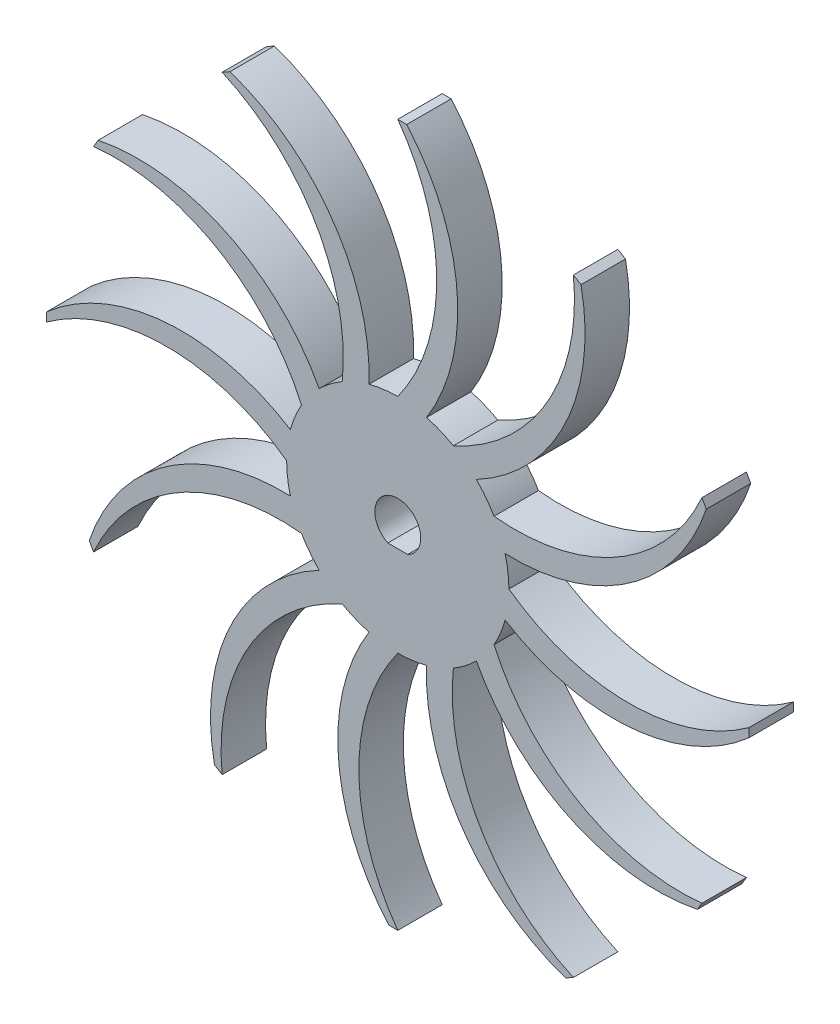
ISO-10303-21;
HEADER;
FILE_DESCRIPTION(('STEP AP214'),'2;1');
FILE_NAME('part.step','',(''),(''),'','','');
FILE_SCHEMA(('AUTOMOTIVE_DESIGN { 1 0 10303 214 1 1 1 1 }'));
ENDSEC;
DATA;
#1=APPLICATION_CONTEXT('core data for automotive mechanical design processes');
#2=APPLICATION_PROTOCOL_DEFINITION('international standard','automotive_design',2000,#1);
#3=PRODUCT_CONTEXT('',#1,'mechanical');
#4=PRODUCT('Part','Part','',(#3));
#5=PRODUCT_RELATED_PRODUCT_CATEGORY('part','',(#4));
#6=PRODUCT_DEFINITION_FORMATION('','',#4);
#7=PRODUCT_DEFINITION_CONTEXT('part definition',#1,'design');
#8=PRODUCT_DEFINITION('design','',#6,#7);
#9=PRODUCT_DEFINITION_SHAPE('','',#8);
#10=(LENGTH_UNIT() NAMED_UNIT(*) SI_UNIT(.MILLI.,.METRE.));
#11=(NAMED_UNIT(*) PLANE_ANGLE_UNIT() SI_UNIT($,.RADIAN.));
#12=(NAMED_UNIT(*) SI_UNIT($,.STERADIAN.) SOLID_ANGLE_UNIT());
#13=UNCERTAINTY_MEASURE_WITH_UNIT(LENGTH_MEASURE(1.E-05),#10,'distance_accuracy_value','');
#14=(GEOMETRIC_REPRESENTATION_CONTEXT(3) GLOBAL_UNCERTAINTY_ASSIGNED_CONTEXT((#13)) GLOBAL_UNIT_ASSIGNED_CONTEXT((#10,
#11,#12)) REPRESENTATION_CONTEXT('',''));
#15=CARTESIAN_POINT('',(0.,0.,0.));
#16=DIRECTION('',(0.,0.,1.));
#17=DIRECTION('',(1.,0.,0.));
#18=AXIS2_PLACEMENT_3D('',#15,#16,#17);
#19=CARTESIAN_POINT('',(0.,0.,5.));
#20=DIRECTION('',(0.,0.,-1.));
#21=DIRECTION('',(-1.,0.,0.));
#22=AXIS2_PLACEMENT_3D('',#19,#20,#21);
#23=CYLINDRICAL_SURFACE('',#22,12.5);
#24=CARTESIAN_POINT('',(0.,0.,0.));
#25=DIRECTION('',(0.,0.,1.));
#26=DIRECTION('',(1.,0.,0.));
#27=AXIS2_PLACEMENT_3D('',#24,#25,#26);
#28=CIRCLE('',#27,12.5);
#29=CARTESIAN_POINT('',(-6.24999999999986,10.8253175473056,0.));
#30=VERTEX_POINT('',#29);
#31=CARTESIAN_POINT('',(-8.83883476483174,8.83883476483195,0.));
#32=VERTEX_POINT('',#31);
#33=EDGE_CURVE('E378',#30,#32,#28,.T.);
#34=ORIENTED_EDGE('',*,*,#33,.T.);
#35=DIRECTION('',(0.,0.,-1.));
#36=VECTOR('',#35,1.);
#37=CARTESIAN_POINT('',(-8.83883476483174,8.83883476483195,5.));
#38=LINE('',#37,#36);
#39=CARTESIAN_POINT('',(-8.83883476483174,8.83883476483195,5.));
#40=VERTEX_POINT('',#39);
#41=EDGE_CURVE('E682',#40,#32,#38,.T.);
#42=ORIENTED_EDGE('',*,*,#41,.F.);
#43=CARTESIAN_POINT('',(0.,0.,5.));
#44=DIRECTION('',(0.,0.,1.));
#45=DIRECTION('',(1.,0.,0.));
#46=AXIS2_PLACEMENT_3D('',#43,#44,#45);
#47=CIRCLE('',#46,12.5);
#48=CARTESIAN_POINT('',(-6.24999999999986,10.8253175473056,5.));
#49=VERTEX_POINT('',#48);
#50=EDGE_CURVE('E375',#49,#40,#47,.T.);
#51=ORIENTED_EDGE('',*,*,#50,.F.);
#52=DIRECTION('',(0.,0.,-1.));
#53=VECTOR('',#52,1.);
#54=CARTESIAN_POINT('',(-6.24999999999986,10.8253175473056,5.));
#55=LINE('',#54,#53);
#56=EDGE_CURVE('E687',#49,#30,#55,.T.);
#57=ORIENTED_EDGE('',*,*,#56,.T.);
#58=EDGE_LOOP('',(#34,#42,#51,#57));
#59=FACE_BOUND('',#58,.T.);
#60=ADVANCED_FACE('F37',(#59),#23,.T.);
#61=CARTESIAN_POINT('',(-26.220381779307,12.9006128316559,5.));
#62=DIRECTION('',(0.,0.,-1.));
#63=DIRECTION('',(-0.866025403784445,-0.499999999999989,0.));
#64=AXIS2_PLACEMENT_3D('',#61,#62,#63);
#65=CYLINDRICAL_SURFACE('',#64,23.);
#66=CARTESIAN_POINT('',(-26.220381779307,12.9006128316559,0.));
#67=DIRECTION('',(0.,0.,1.));
#68=DIRECTION('',(0.866025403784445,0.499999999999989,0.));
#69=AXIS2_PLACEMENT_3D('',#66,#67,#68);
#70=CIRCLE('',#69,23.);
#71=CARTESIAN_POINT('',(-18.8776444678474,34.6970393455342,0.));
#72=VERTEX_POINT('',#71);
#73=CARTESIAN_POINT('',(-3.23523806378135,12.0740728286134,0.));
#74=VERTEX_POINT('',#73);
#75=EDGE_CURVE('E702',#72,#74,#70,.F.);
#76=ORIENTED_EDGE('',*,*,#75,.F.);
#77=DIRECTION('',(0.,0.,-1.));
#78=VECTOR('',#77,1.);
#79=CARTESIAN_POINT('',(-18.8776444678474,34.6970393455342,5.));
#80=LINE('',#79,#78);
#81=CARTESIAN_POINT('',(-18.8776444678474,34.6970393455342,5.));
#82=VERTEX_POINT('',#81);
#83=EDGE_CURVE('E699',#82,#72,#80,.T.);
#84=ORIENTED_EDGE('',*,*,#83,.F.);
#85=CARTESIAN_POINT('',(-26.220381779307,12.9006128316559,5.));
#86=DIRECTION('',(0.,0.,1.));
#87=DIRECTION('',(0.866025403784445,0.499999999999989,0.));
#88=AXIS2_PLACEMENT_3D('',#85,#86,#87);
#89=CIRCLE('',#88,23.);
#90=CARTESIAN_POINT('',(-3.23523806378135,12.0740728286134,5.));
#91=VERTEX_POINT('',#90);
#92=EDGE_CURVE('E45',#82,#91,#89,.F.);
#93=ORIENTED_EDGE('',*,*,#92,.T.);
#94=DIRECTION('',(0.,0.,-1.));
#95=VECTOR('',#94,1.);
#96=CARTESIAN_POINT('',(-3.23523806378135,12.0740728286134,5.));
#97=LINE('',#96,#95);
#98=EDGE_CURVE('E11',#91,#74,#97,.T.);
#99=ORIENTED_EDGE('',*,*,#98,.T.);
#100=EDGE_LOOP('',(#76,#84,#93,#99));
#101=FACE_BOUND('',#100,.T.);
#102=ADVANCED_FACE('F39',(#101),#65,.T.);
#103=CARTESIAN_POINT('',(-19.3138222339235,34.4525213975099,5.));
#104=DIRECTION('',(-0.488996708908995,0.872285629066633,0.));
#105=DIRECTION('',(-0.872285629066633,-0.488996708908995,0.));
#106=AXIS2_PLACEMENT_3D('',#103,#104,#105);
#107=PLANE('',#106);
#108=DIRECTION('',(0.872285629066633,0.488996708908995,0.));
#109=VECTOR('',#108,1.);
#110=CARTESIAN_POINT('',(-19.3138222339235,34.4525213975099,0.));
#111=LINE('',#110,#109);
#112=CARTESIAN_POINT('',(-19.7499999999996,34.2080034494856,0.));
#113=VERTEX_POINT('',#112);
#114=EDGE_CURVE('E695',#113,#72,#111,.T.);
#115=ORIENTED_EDGE('',*,*,#114,.F.);
#116=DIRECTION('',(0.,0.,-1.));
#117=VECTOR('',#116,1.);
#118=CARTESIAN_POINT('',(-19.7499999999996,34.2080034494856,5.));
#119=LINE('',#118,#117);
#120=CARTESIAN_POINT('',(-19.7499999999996,34.2080034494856,5.));
#121=VERTEX_POINT('',#120);
#122=EDGE_CURVE('E692',#121,#113,#119,.T.);
#123=ORIENTED_EDGE('',*,*,#122,.F.);
#124=DIRECTION('',(0.872285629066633,0.488996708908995,0.));
#125=VECTOR('',#124,1.);
#126=CARTESIAN_POINT('',(-19.3138222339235,34.4525213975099,5.));
#127=LINE('',#126,#125);
#128=EDGE_CURVE('E697',#121,#82,#127,.T.);
#129=ORIENTED_EDGE('',*,*,#128,.T.);
#130=ORIENTED_EDGE('',*,*,#83,.T.);
#131=EDGE_LOOP('',(#115,#123,#129,#130));
#132=FACE_BOUND('',#131,.T.);
#133=ADVANCED_FACE('F720',(#132),#107,.T.);
#134=CARTESIAN_POINT('',(-29.12645342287,13.2060482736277,5.));
#135=DIRECTION('',(0.,0.,-1.));
#136=DIRECTION('',(-0.866025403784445,-0.499999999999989,0.));
#137=AXIS2_PLACEMENT_3D('',#134,#135,#136);
#138=CYLINDRICAL_SURFACE('',#137,23.);
#139=CARTESIAN_POINT('',(-29.12645342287,13.2060482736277,0.));
#140=DIRECTION('',(0.,0.,1.));
#141=DIRECTION('',(0.866025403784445,0.499999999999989,0.));
#142=AXIS2_PLACEMENT_3D('',#139,#140,#141);
#143=CIRCLE('',#142,23.);
#144=EDGE_CURVE('E685',#30,#113,#143,.T.);
#145=ORIENTED_EDGE('',*,*,#144,.F.);
#146=ORIENTED_EDGE('',*,*,#56,.F.);
#147=CARTESIAN_POINT('',(-29.12645342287,13.2060482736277,5.));
#148=DIRECTION('',(0.,0.,1.));
#149=DIRECTION('',(0.866025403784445,0.499999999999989,0.));
#150=AXIS2_PLACEMENT_3D('',#147,#148,#149);
#151=CIRCLE('',#150,23.);
#152=EDGE_CURVE('E690',#49,#121,#151,.T.);
#153=ORIENTED_EDGE('',*,*,#152,.T.);
#154=ORIENTED_EDGE('',*,*,#122,.T.);
#155=EDGE_LOOP('',(#145,#146,#153,#154));
#156=FACE_BOUND('',#155,.T.);
#157=ADVANCED_FACE('F726',(#156),#138,.F.);
#158=CARTESIAN_POINT('',(-10.8253175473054,6.25000000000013,0.));
#159=VERTEX_POINT('',#158);
#160=CARTESIAN_POINT('',(-12.0740728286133,3.23523806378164,0.));
#161=VERTEX_POINT('',#160);
#162=EDGE_CURVE('E657',#159,#161,#28,.T.);
#163=ORIENTED_EDGE('',*,*,#162,.T.);
#164=DIRECTION('',(0.,0.,-1.));
#165=VECTOR('',#164,1.);
#166=CARTESIAN_POINT('',(-12.0740728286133,3.23523806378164,5.));
#167=LINE('',#166,#165);
#168=CARTESIAN_POINT('',(-12.0740728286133,3.23523806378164,5.));
#169=VERTEX_POINT('',#168);
#170=EDGE_CURVE('E654',#169,#161,#167,.T.);
#171=ORIENTED_EDGE('',*,*,#170,.F.);
#172=CARTESIAN_POINT('',(-10.8253175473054,6.25000000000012,5.));
#173=VERTEX_POINT('',#172);
#174=EDGE_CURVE('E661',#173,#169,#47,.T.);
#175=ORIENTED_EDGE('',*,*,#174,.F.);
#176=DIRECTION('',(0.,0.,-1.));
#177=VECTOR('',#176,1.);
#178=CARTESIAN_POINT('',(-10.8253175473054,6.25000000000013,5.));
#179=LINE('',#178,#177);
#180=EDGE_CURVE('E660',#173,#159,#179,.T.);
#181=ORIENTED_EDGE('',*,*,#180,.T.);
#182=EDGE_LOOP('',(#163,#171,#175,#181));
#183=FACE_BOUND('',#182,.T.);
#184=ADVANCED_FACE('F776',(#183),#23,.T.);
#185=CARTESIAN_POINT('',(-29.1578231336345,-1.93793245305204,5.));
#186=DIRECTION('',(0.,0.,-1.));
#187=DIRECTION('',(-0.50000000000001,-0.866025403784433,0.));
#188=AXIS2_PLACEMENT_3D('',#185,#186,#187);
#189=CYLINDRICAL_SURFACE('',#188,23.);
#190=CARTESIAN_POINT('',(-29.1578231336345,-1.93793245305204,0.));
#191=DIRECTION('',(0.,0.,1.));
#192=DIRECTION('',(0.50000000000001,0.866025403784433,0.));
#193=AXIS2_PLACEMENT_3D('',#190,#191,#192);
#194=CIRCLE('',#193,23.);
#195=CARTESIAN_POINT('',(-33.6970393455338,20.6096952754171,0.));
#196=VERTEX_POINT('',#195);
#197=EDGE_CURVE('E676',#196,#32,#194,.F.);
#198=ORIENTED_EDGE('',*,*,#197,.F.);
#199=DIRECTION('',(0.,0.,-1.));
#200=VECTOR('',#199,1.);
#201=CARTESIAN_POINT('',(-33.6970393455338,20.6096952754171,5.));
#202=LINE('',#201,#200);
#203=CARTESIAN_POINT('',(-33.6970393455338,20.6096952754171,5.));
#204=VERTEX_POINT('',#203);
#205=EDGE_CURVE('E673',#204,#196,#202,.T.);
#206=ORIENTED_EDGE('',*,*,#205,.F.);
#207=CARTESIAN_POINT('',(-29.1578231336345,-1.93793245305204,5.));
#208=DIRECTION('',(0.,0.,1.));
#209=DIRECTION('',(0.50000000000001,0.866025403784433,0.));
#210=AXIS2_PLACEMENT_3D('',#207,#208,#209);
#211=CIRCLE('',#210,23.);
#212=EDGE_CURVE('E679',#204,#40,#211,.F.);
#213=ORIENTED_EDGE('',*,*,#212,.T.);
#214=ORIENTED_EDGE('',*,*,#41,.T.);
#215=EDGE_LOOP('',(#198,#206,#213,#214));
#216=FACE_BOUND('',#215,.T.);
#217=ADVANCED_FACE('F782',(#216),#189,.T.);
#218=CARTESIAN_POINT('',(-33.9525213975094,20.1798476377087,5.));
#219=DIRECTION('',(-0.859626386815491,0.510923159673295,0.));
#220=DIRECTION('',(-0.510923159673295,-0.859626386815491,0.));
#221=AXIS2_PLACEMENT_3D('',#218,#219,#220);
#222=PLANE('',#221);
#223=DIRECTION('',(0.510923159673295,0.859626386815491,0.));
#224=VECTOR('',#223,1.);
#225=CARTESIAN_POINT('',(-33.9525213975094,20.1798476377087,0.));
#226=LINE('',#225,#224);
#227=CARTESIAN_POINT('',(-34.2080034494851,19.7500000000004,0.));
#228=VERTEX_POINT('',#227);
#229=EDGE_CURVE('E669',#228,#196,#226,.T.);
#230=ORIENTED_EDGE('',*,*,#229,.F.);
#231=DIRECTION('',(0.,0.,-1.));
#232=VECTOR('',#231,1.);
#233=CARTESIAN_POINT('',(-34.2080034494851,19.7500000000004,5.));
#234=LINE('',#233,#232);
#235=CARTESIAN_POINT('',(-34.2080034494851,19.7500000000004,5.));
#236=VERTEX_POINT('',#235);
#237=EDGE_CURVE('E666',#236,#228,#234,.T.);
#238=ORIENTED_EDGE('',*,*,#237,.F.);
#239=DIRECTION('',(0.510923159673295,0.859626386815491,0.));
#240=VECTOR('',#239,1.);
#241=CARTESIAN_POINT('',(-33.9525213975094,20.1798476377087,5.));
#242=LINE('',#241,#240);
#243=EDGE_CURVE('E671',#236,#204,#242,.T.);
#244=ORIENTED_EDGE('',*,*,#243,.T.);
#245=ORIENTED_EDGE('',*,*,#205,.T.);
#246=EDGE_LOOP('',(#230,#238,#244,#245));
#247=FACE_BOUND('',#246,.T.);
#248=ADVANCED_FACE('F911',(#247),#222,.T.);
#249=CARTESIAN_POINT('',(-31.8272727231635,-3.12645342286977,5.));
#250=DIRECTION('',(0.,0.,-1.));
#251=DIRECTION('',(-0.50000000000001,-0.866025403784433,0.));
#252=AXIS2_PLACEMENT_3D('',#249,#250,#251);
#253=CYLINDRICAL_SURFACE('',#252,23.);
#254=CARTESIAN_POINT('',(-31.8272727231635,-3.12645342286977,0.));
#255=DIRECTION('',(0.,0.,1.));
#256=DIRECTION('',(0.50000000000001,0.866025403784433,0.));
#257=AXIS2_PLACEMENT_3D('',#254,#255,#256);
#258=CIRCLE('',#257,23.);
#259=EDGE_CURVE('E658',#159,#228,#258,.T.);
#260=ORIENTED_EDGE('',*,*,#259,.F.);
#261=ORIENTED_EDGE('',*,*,#180,.F.);
#262=CARTESIAN_POINT('',(-31.8272727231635,-3.12645342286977,5.));
#263=DIRECTION('',(0.,0.,1.));
#264=DIRECTION('',(0.50000000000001,0.866025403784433,0.));
#265=AXIS2_PLACEMENT_3D('',#262,#263,#264);
#266=CIRCLE('',#265,23.);
#267=EDGE_CURVE('E664',#173,#236,#266,.T.);
#268=ORIENTED_EDGE('',*,*,#267,.T.);
#269=ORIENTED_EDGE('',*,*,#237,.T.);
#270=EDGE_LOOP('',(#260,#261,#268,#269));
#271=FACE_BOUND('',#270,.T.);
#272=ADVANCED_FACE('F903',(#271),#253,.F.);
#273=CARTESIAN_POINT('',(-12.5,1.30930550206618E-13,0.));
#274=VERTEX_POINT('',#273);
#275=CARTESIAN_POINT('',(-12.0740728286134,-3.23523806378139,0.));
#276=VERTEX_POINT('',#275);
#277=EDGE_CURVE('E629',#274,#276,#28,.T.);
#278=ORIENTED_EDGE('',*,*,#277,.T.);
#279=DIRECTION('',(0.,0.,-1.));
#280=VECTOR('',#279,1.);
#281=CARTESIAN_POINT('',(-12.0740728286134,-3.23523806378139,5.));
#282=LINE('',#281,#280);
#283=CARTESIAN_POINT('',(-12.0740728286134,-3.23523806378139,5.));
#284=VERTEX_POINT('',#283);
#285=EDGE_CURVE('E626',#284,#276,#282,.T.);
#286=ORIENTED_EDGE('',*,*,#285,.F.);
#287=CARTESIAN_POINT('',(-12.5,1.27461103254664E-13,5.));
#288=VERTEX_POINT('',#287);
#289=EDGE_CURVE('E633',#288,#284,#47,.T.);
#290=ORIENTED_EDGE('',*,*,#289,.F.);
#291=DIRECTION('',(0.,0.,-1.));
#292=VECTOR('',#291,1.);
#293=CARTESIAN_POINT('',(-12.5,1.30930550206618E-13,5.));
#294=LINE('',#293,#292);
#295=EDGE_CURVE('E632',#288,#274,#294,.T.);
#296=ORIENTED_EDGE('',*,*,#295,.T.);
#297=EDGE_LOOP('',(#278,#286,#290,#296));
#298=FACE_BOUND('',#297,.T.);
#299=ADVANCED_FACE('F784',(#298),#23,.T.);
#300=CARTESIAN_POINT('',(-24.282449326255,-16.2572103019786,5.));
#301=DIRECTION('',(0.,0.,-1.));
#302=DIRECTION('',(0.,-1.,0.));
#303=AXIS2_PLACEMENT_3D('',#300,#301,#302);
#304=CYLINDRICAL_SURFACE('',#303,23.);
#305=CARTESIAN_POINT('',(-24.282449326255,-16.2572103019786,0.));
#306=DIRECTION('',(0.,0.,1.));
#307=DIRECTION('',(0.,1.,0.));
#308=AXIS2_PLACEMENT_3D('',#305,#306,#307);
#309=CIRCLE('',#308,23.);
#310=CARTESIAN_POINT('',(-39.4873397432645,1.00000000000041,0.));
#311=VERTEX_POINT('',#310);
#312=EDGE_CURVE('E648',#311,#161,#309,.F.);
#313=ORIENTED_EDGE('',*,*,#312,.F.);
#314=DIRECTION('',(0.,0.,-1.));
#315=VECTOR('',#314,1.);
#316=CARTESIAN_POINT('',(-39.4873397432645,1.00000000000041,5.));
#317=LINE('',#316,#315);
#318=CARTESIAN_POINT('',(-39.4873397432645,1.00000000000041,5.));
#319=VERTEX_POINT('',#318);
#320=EDGE_CURVE('E645',#319,#311,#317,.T.);
#321=ORIENTED_EDGE('',*,*,#320,.F.);
#322=CARTESIAN_POINT('',(-24.282449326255,-16.2572103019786,5.));
#323=DIRECTION('',(0.,0.,1.));
#324=DIRECTION('',(0.,1.,0.));
#325=AXIS2_PLACEMENT_3D('',#322,#323,#324);
#326=CIRCLE('',#325,23.);
#327=EDGE_CURVE('E651',#319,#169,#326,.F.);
#328=ORIENTED_EDGE('',*,*,#327,.T.);
#329=ORIENTED_EDGE('',*,*,#170,.T.);
#330=EDGE_LOOP('',(#313,#321,#328,#329));
#331=FACE_BOUND('',#330,.T.);
#332=ADVANCED_FACE('F902',(#331),#304,.T.);
#333=CARTESIAN_POINT('',(-39.4936698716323,0.500000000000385,5.));
#334=DIRECTION('',(-0.999919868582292,0.0126592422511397,0.));
#335=DIRECTION('',(-0.0126592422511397,-0.999919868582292,0.));
#336=AXIS2_PLACEMENT_3D('',#333,#334,#335);
#337=PLANE('',#336);
#338=DIRECTION('',(0.0126592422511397,0.999919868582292,0.));
#339=VECTOR('',#338,1.);
#340=CARTESIAN_POINT('',(-39.4936698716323,0.500000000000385,0.));
#341=LINE('',#340,#339);
#342=CARTESIAN_POINT('',(-39.5,4.13740538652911E-13,0.));
#343=VERTEX_POINT('',#342);
#344=EDGE_CURVE('E641',#343,#311,#341,.T.);
#345=ORIENTED_EDGE('',*,*,#344,.F.);
#346=DIRECTION('',(0.,0.,-1.));
#347=VECTOR('',#346,1.);
#348=CARTESIAN_POINT('',(-39.5,4.13740538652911E-13,5.));
#349=LINE('',#348,#347);
#350=CARTESIAN_POINT('',(-39.5,4.13740538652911E-13,5.));
#351=VERTEX_POINT('',#350);
#352=EDGE_CURVE('E638',#351,#343,#349,.T.);
#353=ORIENTED_EDGE('',*,*,#352,.F.);
#354=DIRECTION('',(0.0126592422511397,0.999919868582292,0.));
#355=VECTOR('',#354,1.);
#356=CARTESIAN_POINT('',(-39.4936698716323,0.500000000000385,5.));
#357=LINE('',#356,#355);
#358=EDGE_CURVE('E643',#351,#319,#357,.T.);
#359=ORIENTED_EDGE('',*,*,#358,.T.);
#360=ORIENTED_EDGE('',*,*,#320,.T.);
#361=EDGE_LOOP('',(#345,#353,#359,#360));
#362=FACE_BOUND('',#361,.T.);
#363=ADVANCED_FACE('F898',(#362),#337,.T.);
#364=CARTESIAN_POINT('',(-26.0000000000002,-18.6212244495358,5.));
#365=DIRECTION('',(0.,0.,-1.));
#366=DIRECTION('',(0.,-1.,0.));
#367=AXIS2_PLACEMENT_3D('',#364,#365,#366);
#368=CYLINDRICAL_SURFACE('',#367,23.);
#369=CARTESIAN_POINT('',(-26.0000000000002,-18.6212244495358,0.));
#370=DIRECTION('',(0.,0.,1.));
#371=DIRECTION('',(0.,1.,0.));
#372=AXIS2_PLACEMENT_3D('',#369,#370,#371);
#373=CIRCLE('',#372,23.);
#374=EDGE_CURVE('E630',#274,#343,#373,.T.);
#375=ORIENTED_EDGE('',*,*,#374,.F.);
#376=ORIENTED_EDGE('',*,*,#295,.F.);
#377=CARTESIAN_POINT('',(-26.0000000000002,-18.6212244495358,5.));
#378=DIRECTION('',(0.,0.,1.));
#379=DIRECTION('',(0.,1.,0.));
#380=AXIS2_PLACEMENT_3D('',#377,#378,#379);
#381=CIRCLE('',#380,23.);
#382=EDGE_CURVE('E636',#288,#351,#381,.T.);
#383=ORIENTED_EDGE('',*,*,#382,.T.);
#384=ORIENTED_EDGE('',*,*,#352,.T.);
#385=EDGE_LOOP('',(#375,#376,#383,#384));
#386=FACE_BOUND('',#385,.T.);
#387=ADVANCED_FACE('F890',(#386),#368,.F.);
#388=CARTESIAN_POINT('',(-10.8253175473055,-6.2499999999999,0.));
#389=VERTEX_POINT('',#388);
#390=CARTESIAN_POINT('',(-8.83883476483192,-8.83883476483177,0.));
#391=VERTEX_POINT('',#390);
#392=EDGE_CURVE('E601',#389,#391,#28,.T.);
#393=ORIENTED_EDGE('',*,*,#392,.T.);
#394=DIRECTION('',(0.,0.,-1.));
#395=VECTOR('',#394,1.);
#396=CARTESIAN_POINT('',(-8.83883476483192,-8.83883476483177,5.));
#397=LINE('',#396,#395);
#398=CARTESIAN_POINT('',(-8.83883476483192,-8.83883476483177,5.));
#399=VERTEX_POINT('',#398);
#400=EDGE_CURVE('E598',#399,#391,#397,.T.);
#401=ORIENTED_EDGE('',*,*,#400,.F.);
#402=CARTESIAN_POINT('',(-10.8253175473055,-6.2499999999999,5.));
#403=VERTEX_POINT('',#402);
#404=EDGE_CURVE('E605',#403,#399,#47,.T.);
#405=ORIENTED_EDGE('',*,*,#404,.F.);
#406=DIRECTION('',(0.,0.,-1.));
#407=VECTOR('',#406,1.);
#408=CARTESIAN_POINT('',(-10.8253175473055,-6.2499999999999,5.));
#409=LINE('',#408,#407);
#410=EDGE_CURVE('E604',#403,#389,#409,.T.);
#411=ORIENTED_EDGE('',*,*,#410,.T.);
#412=EDGE_LOOP('',(#393,#401,#405,#411));
#413=FACE_BOUND('',#412,.T.);
#414=ADVANCED_FACE('F878',(#413),#23,.T.);
#415=CARTESIAN_POINT('',(-12.9006128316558,-26.2203817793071,5.));
#416=DIRECTION('',(0.,0.,-1.));
#417=DIRECTION('',(0.499999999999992,-0.866025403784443,0.));
#418=AXIS2_PLACEMENT_3D('',#415,#416,#417);
#419=CYLINDRICAL_SURFACE('',#418,23.);
#420=CARTESIAN_POINT('',(-12.9006128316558,-26.2203817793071,0.));
#421=DIRECTION('',(0.,0.,1.));
#422=DIRECTION('',(-0.499999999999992,0.866025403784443,0.));
#423=AXIS2_PLACEMENT_3D('',#420,#421,#422);
#424=CIRCLE('',#423,23.);
#425=CARTESIAN_POINT('',(-34.6970393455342,-18.8776444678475,0.));
#426=VERTEX_POINT('',#425);
#427=EDGE_CURVE('E620',#426,#276,#424,.F.);
#428=ORIENTED_EDGE('',*,*,#427,.F.);
#429=DIRECTION('',(0.,0.,-1.));
#430=VECTOR('',#429,1.);
#431=CARTESIAN_POINT('',(-34.6970393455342,-18.8776444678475,5.));
#432=LINE('',#431,#430);
#433=CARTESIAN_POINT('',(-34.6970393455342,-18.8776444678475,5.));
#434=VERTEX_POINT('',#433);
#435=EDGE_CURVE('E617',#434,#426,#432,.T.);
#436=ORIENTED_EDGE('',*,*,#435,.F.);
#437=CARTESIAN_POINT('',(-12.9006128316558,-26.2203817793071,5.));
#438=DIRECTION('',(0.,0.,1.));
#439=DIRECTION('',(-0.499999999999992,0.866025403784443,0.));
#440=AXIS2_PLACEMENT_3D('',#437,#438,#439);
#441=CIRCLE('',#440,23.);
#442=EDGE_CURVE('E623',#434,#284,#441,.F.);
#443=ORIENTED_EDGE('',*,*,#442,.T.);
#444=ORIENTED_EDGE('',*,*,#285,.T.);
#445=EDGE_LOOP('',(#428,#436,#443,#444));
#446=FACE_BOUND('',#445,.T.);
#447=ADVANCED_FACE('F889',(#446),#419,.T.);
#448=CARTESIAN_POINT('',(-34.4525213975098,-19.3138222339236,5.));
#449=DIRECTION('',(-0.872285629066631,-0.488996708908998,0.));
#450=DIRECTION('',(0.488996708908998,-0.872285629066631,0.));
#451=AXIS2_PLACEMENT_3D('',#448,#449,#450);
#452=PLANE('',#451);
#453=DIRECTION('',(-0.488996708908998,0.872285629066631,0.));
#454=VECTOR('',#453,1.);
#455=CARTESIAN_POINT('',(-34.4525213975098,-19.3138222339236,0.));
#456=LINE('',#455,#454);
#457=CARTESIAN_POINT('',(-34.2080034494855,-19.7499999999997,0.));
#458=VERTEX_POINT('',#457);
#459=EDGE_CURVE('E613',#458,#426,#456,.T.);
#460=ORIENTED_EDGE('',*,*,#459,.F.);
#461=DIRECTION('',(0.,0.,-1.));
#462=VECTOR('',#461,1.);
#463=CARTESIAN_POINT('',(-34.2080034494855,-19.7499999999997,5.));
#464=LINE('',#463,#462);
#465=CARTESIAN_POINT('',(-34.2080034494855,-19.7499999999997,5.));
#466=VERTEX_POINT('',#465);
#467=EDGE_CURVE('E610',#466,#458,#464,.T.);
#468=ORIENTED_EDGE('',*,*,#467,.F.);
#469=DIRECTION('',(-0.488996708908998,0.872285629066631,0.));
#470=VECTOR('',#469,1.);
#471=CARTESIAN_POINT('',(-34.4525213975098,-19.3138222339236,5.));
#472=LINE('',#471,#470);
#473=EDGE_CURVE('E615',#466,#434,#472,.T.);
#474=ORIENTED_EDGE('',*,*,#473,.T.);
#475=ORIENTED_EDGE('',*,*,#435,.T.);
#476=EDGE_LOOP('',(#460,#468,#474,#475));
#477=FACE_BOUND('',#476,.T.);
#478=ADVANCED_FACE('F885',(#477),#452,.T.);
#479=CARTESIAN_POINT('',(-13.2060482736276,-29.12645342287,5.));
#480=DIRECTION('',(0.,0.,-1.));
#481=DIRECTION('',(0.499999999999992,-0.866025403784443,0.));
#482=AXIS2_PLACEMENT_3D('',#479,#480,#481);
#483=CYLINDRICAL_SURFACE('',#482,23.);
#484=CARTESIAN_POINT('',(-13.2060482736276,-29.12645342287,0.));
#485=DIRECTION('',(0.,0.,1.));
#486=DIRECTION('',(-0.499999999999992,0.866025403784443,0.));
#487=AXIS2_PLACEMENT_3D('',#484,#485,#486);
#488=CIRCLE('',#487,23.);
#489=EDGE_CURVE('E602',#389,#458,#488,.T.);
#490=ORIENTED_EDGE('',*,*,#489,.F.);
#491=ORIENTED_EDGE('',*,*,#410,.F.);
#492=CARTESIAN_POINT('',(-13.2060482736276,-29.12645342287,5.));
#493=DIRECTION('',(0.,0.,1.));
#494=DIRECTION('',(-0.499999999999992,0.866025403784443,0.));
#495=AXIS2_PLACEMENT_3D('',#492,#493,#494);
#496=CIRCLE('',#495,23.);
#497=EDGE_CURVE('E608',#403,#466,#496,.T.);
#498=ORIENTED_EDGE('',*,*,#497,.T.);
#499=ORIENTED_EDGE('',*,*,#467,.T.);
#500=EDGE_LOOP('',(#490,#491,#498,#499));
#501=FACE_BOUND('',#500,.T.);
#502=ADVANCED_FACE('F876',(#501),#483,.F.);
#503=CARTESIAN_POINT('',(-6.25000000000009,-10.8253175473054,0.));
#504=VERTEX_POINT('',#503);
#505=CARTESIAN_POINT('',(-3.23523806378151,-12.0740728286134,0.));
#506=VERTEX_POINT('',#505);
#507=EDGE_CURVE('E573',#504,#506,#28,.T.);
#508=ORIENTED_EDGE('',*,*,#507,.T.);
#509=DIRECTION('',(0.,0.,-1.));
#510=VECTOR('',#509,1.);
#511=CARTESIAN_POINT('',(-3.23523806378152,-12.0740728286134,5.));
#512=LINE('',#511,#510);
#513=CARTESIAN_POINT('',(-3.23523806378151,-12.0740728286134,5.));
#514=VERTEX_POINT('',#513);
#515=EDGE_CURVE('E570',#514,#506,#512,.T.);
#516=ORIENTED_EDGE('',*,*,#515,.F.);
#517=CARTESIAN_POINT('',(-6.25000000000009,-10.8253175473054,5.));
#518=VERTEX_POINT('',#517);
#519=EDGE_CURVE('E577',#518,#514,#47,.T.);
#520=ORIENTED_EDGE('',*,*,#519,.F.);
#521=DIRECTION('',(0.,0.,-1.));
#522=VECTOR('',#521,1.);
#523=CARTESIAN_POINT('',(-6.25000000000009,-10.8253175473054,5.));
#524=LINE('',#523,#522);
#525=EDGE_CURVE('E576',#518,#504,#524,.T.);
#526=ORIENTED_EDGE('',*,*,#525,.T.);
#527=EDGE_LOOP('',(#508,#516,#520,#526));
#528=FACE_BOUND('',#527,.T.);
#529=ADVANCED_FACE('F864',(#528),#23,.T.);
#530=CARTESIAN_POINT('',(1.93793245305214,-29.1578231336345,5.));
#531=DIRECTION('',(0.,0.,-1.));
#532=DIRECTION('',(0.866025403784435,-0.500000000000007,0.));
#533=AXIS2_PLACEMENT_3D('',#530,#531,#532);
#534=CYLINDRICAL_SURFACE('',#533,23.);
#535=CARTESIAN_POINT('',(1.93793245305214,-29.1578231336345,0.));
#536=DIRECTION('',(0.,0.,1.));
#537=DIRECTION('',(-0.866025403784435,0.500000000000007,0.));
#538=AXIS2_PLACEMENT_3D('',#535,#536,#537);
#539=CIRCLE('',#538,23.);
#540=CARTESIAN_POINT('',(-20.609695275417,-33.6970393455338,0.));
#541=VERTEX_POINT('',#540);
#542=EDGE_CURVE('E592',#541,#391,#539,.F.);
#543=ORIENTED_EDGE('',*,*,#542,.F.);
#544=DIRECTION('',(0.,0.,-1.));
#545=VECTOR('',#544,1.);
#546=CARTESIAN_POINT('',(-20.609695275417,-33.6970393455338,5.));
#547=LINE('',#546,#545);
#548=CARTESIAN_POINT('',(-20.609695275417,-33.6970393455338,5.));
#549=VERTEX_POINT('',#548);
#550=EDGE_CURVE('E589',#549,#541,#547,.T.);
#551=ORIENTED_EDGE('',*,*,#550,.F.);
#552=CARTESIAN_POINT('',(1.93793245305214,-29.1578231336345,5.));
#553=DIRECTION('',(0.,0.,1.));
#554=DIRECTION('',(-0.866025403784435,0.500000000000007,0.));
#555=AXIS2_PLACEMENT_3D('',#552,#553,#554);
#556=CIRCLE('',#555,23.);
#557=EDGE_CURVE('E595',#549,#399,#556,.F.);
#558=ORIENTED_EDGE('',*,*,#557,.T.);
#559=ORIENTED_EDGE('',*,*,#400,.T.);
#560=EDGE_LOOP('',(#543,#551,#558,#559));
#561=FACE_BOUND('',#560,.T.);
#562=ADVANCED_FACE('F875',(#561),#534,.T.);
#563=CARTESIAN_POINT('',(-20.1798476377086,-33.9525213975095,5.));
#564=DIRECTION('',(-0.510923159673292,-0.859626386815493,0.));
#565=DIRECTION('',(0.859626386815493,-0.510923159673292,0.));
#566=AXIS2_PLACEMENT_3D('',#563,#564,#565);
#567=PLANE('',#566);
#568=DIRECTION('',(-0.859626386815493,0.510923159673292,0.));
#569=VECTOR('',#568,1.);
#570=CARTESIAN_POINT('',(-20.1798476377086,-33.9525213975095,0.));
#571=LINE('',#570,#569);
#572=CARTESIAN_POINT('',(-19.7500000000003,-34.2080034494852,0.));
#573=VERTEX_POINT('',#572);
#574=EDGE_CURVE('E585',#573,#541,#571,.T.);
#575=ORIENTED_EDGE('',*,*,#574,.F.);
#576=DIRECTION('',(0.,0.,-1.));
#577=VECTOR('',#576,1.);
#578=CARTESIAN_POINT('',(-19.7500000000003,-34.2080034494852,5.));
#579=LINE('',#578,#577);
#580=CARTESIAN_POINT('',(-19.7500000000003,-34.2080034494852,5.));
#581=VERTEX_POINT('',#580);
#582=EDGE_CURVE('E582',#581,#573,#579,.T.);
#583=ORIENTED_EDGE('',*,*,#582,.F.);
#584=DIRECTION('',(-0.859626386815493,0.510923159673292,0.));
#585=VECTOR('',#584,1.);
#586=CARTESIAN_POINT('',(-20.1798476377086,-33.9525213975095,5.));
#587=LINE('',#586,#585);
#588=EDGE_CURVE('E587',#581,#549,#587,.T.);
#589=ORIENTED_EDGE('',*,*,#588,.T.);
#590=ORIENTED_EDGE('',*,*,#550,.T.);
#591=EDGE_LOOP('',(#575,#583,#589,#590));
#592=FACE_BOUND('',#591,.T.);
#593=ADVANCED_FACE('F871',(#592),#567,.T.);
#594=CARTESIAN_POINT('',(3.12645342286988,-31.8272727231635,5.));
#595=DIRECTION('',(0.,0.,-1.));
#596=DIRECTION('',(0.866025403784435,-0.500000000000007,0.));
#597=AXIS2_PLACEMENT_3D('',#594,#595,#596);
#598=CYLINDRICAL_SURFACE('',#597,23.);
#599=CARTESIAN_POINT('',(3.12645342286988,-31.8272727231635,0.));
#600=DIRECTION('',(0.,0.,1.));
#601=DIRECTION('',(-0.866025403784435,0.500000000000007,0.));
#602=AXIS2_PLACEMENT_3D('',#599,#600,#601);
#603=CIRCLE('',#602,23.);
#604=EDGE_CURVE('E574',#504,#573,#603,.T.);
#605=ORIENTED_EDGE('',*,*,#604,.F.);
#606=ORIENTED_EDGE('',*,*,#525,.F.);
#607=CARTESIAN_POINT('',(3.12645342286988,-31.8272727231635,5.));
#608=DIRECTION('',(0.,0.,1.));
#609=DIRECTION('',(-0.866025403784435,0.500000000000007,0.));
#610=AXIS2_PLACEMENT_3D('',#607,#608,#609);
#611=CIRCLE('',#610,23.);
#612=EDGE_CURVE('E580',#518,#581,#611,.T.);
#613=ORIENTED_EDGE('',*,*,#612,.T.);
#614=ORIENTED_EDGE('',*,*,#582,.T.);
#615=EDGE_LOOP('',(#605,#606,#613,#614));
#616=FACE_BOUND('',#615,.T.);
#617=ADVANCED_FACE('F862',(#616),#598,.F.);
#618=CARTESIAN_POINT('',(0.,-12.5,0.));
#619=VERTEX_POINT('',#618);
#620=CARTESIAN_POINT('',(3.23523806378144,-12.0740728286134,0.));
#621=VERTEX_POINT('',#620);
#622=EDGE_CURVE('E545',#619,#621,#28,.T.);
#623=ORIENTED_EDGE('',*,*,#622,.T.);
#624=DIRECTION('',(0.,0.,-1.));
#625=VECTOR('',#624,1.);
#626=CARTESIAN_POINT('',(3.23523806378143,-12.0740728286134,5.));
#627=LINE('',#626,#625);
#628=CARTESIAN_POINT('',(3.23523806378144,-12.0740728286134,5.));
#629=VERTEX_POINT('',#628);
#630=EDGE_CURVE('E542',#629,#621,#627,.T.);
#631=ORIENTED_EDGE('',*,*,#630,.F.);
#632=CARTESIAN_POINT('',(0.,-12.5,5.));
#633=VERTEX_POINT('',#632);
#634=EDGE_CURVE('E549',#633,#629,#47,.T.);
#635=ORIENTED_EDGE('',*,*,#634,.F.);
#636=DIRECTION('',(0.,0.,-1.));
#637=VECTOR('',#636,1.);
#638=CARTESIAN_POINT('',(0.,-12.5,5.));
#639=LINE('',#638,#637);
#640=EDGE_CURVE('E548',#633,#619,#639,.T.);
#641=ORIENTED_EDGE('',*,*,#640,.T.);
#642=EDGE_LOOP('',(#623,#631,#635,#641));
#643=FACE_BOUND('',#642,.T.);
#644=ADVANCED_FACE('F850',(#643),#23,.T.);
#645=CARTESIAN_POINT('',(16.2572103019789,-24.2824493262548,5.));
#646=DIRECTION('',(0.,0.,-1.));
#647=DIRECTION('',(1.,0.,0.));
#648=AXIS2_PLACEMENT_3D('',#645,#646,#647);
#649=CYLINDRICAL_SURFACE('',#648,23.);
#650=CARTESIAN_POINT('',(16.2572103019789,-24.2824493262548,0.));
#651=DIRECTION('',(0.,0.,1.));
#652=DIRECTION('',(-1.,0.,0.));
#653=AXIS2_PLACEMENT_3D('',#650,#651,#652);
#654=CIRCLE('',#653,23.);
#655=CARTESIAN_POINT('',(-1.,-39.4873397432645,0.));
#656=VERTEX_POINT('',#655);
#657=EDGE_CURVE('E564',#656,#506,#654,.F.);
#658=ORIENTED_EDGE('',*,*,#657,.F.);
#659=DIRECTION('',(0.,0.,-1.));
#660=VECTOR('',#659,1.);
#661=CARTESIAN_POINT('',(-1.,-39.4873397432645,5.));
#662=LINE('',#661,#660);
#663=CARTESIAN_POINT('',(-1.,-39.4873397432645,5.));
#664=VERTEX_POINT('',#663);
#665=EDGE_CURVE('E561',#664,#656,#662,.T.);
#666=ORIENTED_EDGE('',*,*,#665,.F.);
#667=CARTESIAN_POINT('',(16.2572103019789,-24.2824493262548,5.));
#668=DIRECTION('',(0.,0.,1.));
#669=DIRECTION('',(-1.,0.,0.));
#670=AXIS2_PLACEMENT_3D('',#667,#668,#669);
#671=CIRCLE('',#670,23.);
#672=EDGE_CURVE('E567',#664,#514,#671,.F.);
#673=ORIENTED_EDGE('',*,*,#672,.T.);
#674=ORIENTED_EDGE('',*,*,#515,.T.);
#675=EDGE_LOOP('',(#658,#666,#673,#674));
#676=FACE_BOUND('',#675,.T.);
#677=ADVANCED_FACE('F861',(#676),#649,.T.);
#678=CARTESIAN_POINT('',(-0.499999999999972,-39.4936698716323,5.));
#679=DIRECTION('',(-0.0126592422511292,-0.999919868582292,0.));
#680=DIRECTION('',(0.999919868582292,-0.0126592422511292,0.));
#681=AXIS2_PLACEMENT_3D('',#678,#679,#680);
#682=PLANE('',#681);
#683=DIRECTION('',(-0.999919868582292,0.0126592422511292,0.));
#684=VECTOR('',#683,1.);
#685=CARTESIAN_POINT('',(-0.499999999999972,-39.4936698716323,0.));
#686=LINE('',#685,#684);
#687=CARTESIAN_POINT('',(0.,-39.5,0.));
#688=VERTEX_POINT('',#687);
#689=EDGE_CURVE('E557',#688,#656,#686,.T.);
#690=ORIENTED_EDGE('',*,*,#689,.F.);
#691=DIRECTION('',(0.,0.,-1.));
#692=VECTOR('',#691,1.);
#693=CARTESIAN_POINT('',(0.,-39.5,5.));
#694=LINE('',#693,#692);
#695=CARTESIAN_POINT('',(0.,-39.5,5.));
#696=VERTEX_POINT('',#695);
#697=EDGE_CURVE('E554',#696,#688,#694,.T.);
#698=ORIENTED_EDGE('',*,*,#697,.F.);
#699=DIRECTION('',(-0.999919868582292,0.0126592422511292,0.));
#700=VECTOR('',#699,1.);
#701=CARTESIAN_POINT('',(-0.499999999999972,-39.4936698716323,5.));
#702=LINE('',#701,#700);
#703=EDGE_CURVE('E559',#696,#664,#702,.T.);
#704=ORIENTED_EDGE('',*,*,#703,.T.);
#705=ORIENTED_EDGE('',*,*,#665,.T.);
#706=EDGE_LOOP('',(#690,#698,#704,#705));
#707=FACE_BOUND('',#706,.T.);
#708=ADVANCED_FACE('F857',(#707),#682,.T.);
#709=CARTESIAN_POINT('',(18.6212244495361,-26.,5.));
#710=DIRECTION('',(0.,0.,-1.));
#711=DIRECTION('',(1.,0.,0.));
#712=AXIS2_PLACEMENT_3D('',#709,#710,#711);
#713=CYLINDRICAL_SURFACE('',#712,23.);
#714=CARTESIAN_POINT('',(18.6212244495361,-26.,0.));
#715=DIRECTION('',(0.,0.,1.));
#716=DIRECTION('',(-1.,0.,0.));
#717=AXIS2_PLACEMENT_3D('',#714,#715,#716);
#718=CIRCLE('',#717,23.);
#719=EDGE_CURVE('E546',#619,#688,#718,.T.);
#720=ORIENTED_EDGE('',*,*,#719,.F.);
#721=ORIENTED_EDGE('',*,*,#640,.F.);
#722=CARTESIAN_POINT('',(18.6212244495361,-26.,5.));
#723=DIRECTION('',(0.,0.,1.));
#724=DIRECTION('',(-1.,0.,0.));
#725=AXIS2_PLACEMENT_3D('',#722,#723,#724);
#726=CIRCLE('',#725,23.);
#727=EDGE_CURVE('E552',#633,#696,#726,.T.);
#728=ORIENTED_EDGE('',*,*,#727,.T.);
#729=ORIENTED_EDGE('',*,*,#697,.T.);
#730=EDGE_LOOP('',(#720,#721,#728,#729));
#731=FACE_BOUND('',#730,.T.);
#732=ADVANCED_FACE('F848',(#731),#713,.F.);
#733=CARTESIAN_POINT('',(6.24999999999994,-10.8253175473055,0.));
#734=VERTEX_POINT('',#733);
#735=CARTESIAN_POINT('',(8.8388347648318,-8.83883476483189,0.));
#736=VERTEX_POINT('',#735);
#737=EDGE_CURVE('E517',#734,#736,#28,.T.);
#738=ORIENTED_EDGE('',*,*,#737,.T.);
#739=DIRECTION('',(0.,0.,-1.));
#740=VECTOR('',#739,1.);
#741=CARTESIAN_POINT('',(8.8388347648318,-8.83883476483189,5.));
#742=LINE('',#741,#740);
#743=CARTESIAN_POINT('',(8.8388347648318,-8.83883476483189,5.));
#744=VERTEX_POINT('',#743);
#745=EDGE_CURVE('E514',#744,#736,#742,.T.);
#746=ORIENTED_EDGE('',*,*,#745,.F.);
#747=CARTESIAN_POINT('',(6.24999999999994,-10.8253175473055,5.));
#748=VERTEX_POINT('',#747);
#749=EDGE_CURVE('E521',#748,#744,#47,.T.);
#750=ORIENTED_EDGE('',*,*,#749,.F.);
#751=DIRECTION('',(0.,0.,-1.));
#752=VECTOR('',#751,1.);
#753=CARTESIAN_POINT('',(6.24999999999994,-10.8253175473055,5.));
#754=LINE('',#753,#752);
#755=EDGE_CURVE('E520',#748,#734,#754,.T.);
#756=ORIENTED_EDGE('',*,*,#755,.T.);
#757=EDGE_LOOP('',(#738,#746,#750,#756));
#758=FACE_BOUND('',#757,.T.);
#759=ADVANCED_FACE('F836',(#758),#23,.T.);
#760=CARTESIAN_POINT('',(26.2203817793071,-12.9006128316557,5.));
#761=DIRECTION('',(0.,0.,-1.));
#762=DIRECTION('',(0.866025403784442,0.499999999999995,0.));
#763=AXIS2_PLACEMENT_3D('',#760,#761,#762);
#764=CYLINDRICAL_SURFACE('',#763,23.);
#765=CARTESIAN_POINT('',(26.2203817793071,-12.9006128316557,0.));
#766=DIRECTION('',(0.,0.,1.));
#767=DIRECTION('',(-0.866025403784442,-0.499999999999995,0.));
#768=AXIS2_PLACEMENT_3D('',#765,#766,#767);
#769=CIRCLE('',#768,23.);
#770=CARTESIAN_POINT('',(18.8776444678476,-34.6970393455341,0.));
#771=VERTEX_POINT('',#770);
#772=EDGE_CURVE('E536',#771,#621,#769,.F.);
#773=ORIENTED_EDGE('',*,*,#772,.F.);
#774=DIRECTION('',(0.,0.,-1.));
#775=VECTOR('',#774,1.);
#776=CARTESIAN_POINT('',(18.8776444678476,-34.6970393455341,5.));
#777=LINE('',#776,#775);
#778=CARTESIAN_POINT('',(18.8776444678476,-34.6970393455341,5.));
#779=VERTEX_POINT('',#778);
#780=EDGE_CURVE('E533',#779,#771,#777,.T.);
#781=ORIENTED_EDGE('',*,*,#780,.F.);
#782=CARTESIAN_POINT('',(26.2203817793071,-12.9006128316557,5.));
#783=DIRECTION('',(0.,0.,1.));
#784=DIRECTION('',(-0.866025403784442,-0.499999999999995,0.));
#785=AXIS2_PLACEMENT_3D('',#782,#783,#784);
#786=CIRCLE('',#785,23.);
#787=EDGE_CURVE('E539',#779,#629,#786,.F.);
#788=ORIENTED_EDGE('',*,*,#787,.T.);
#789=ORIENTED_EDGE('',*,*,#630,.T.);
#790=EDGE_LOOP('',(#773,#781,#788,#789));
#791=FACE_BOUND('',#790,.T.);
#792=ADVANCED_FACE('F847',(#791),#764,.T.);
#793=CARTESIAN_POINT('',(19.3138222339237,-34.4525213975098,5.));
#794=DIRECTION('',(0.488996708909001,-0.872285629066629,0.));
#795=DIRECTION('',(0.872285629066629,0.488996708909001,0.));
#796=AXIS2_PLACEMENT_3D('',#793,#794,#795);
#797=PLANE('',#796);
#798=DIRECTION('',(-0.872285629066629,-0.488996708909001,0.));
#799=VECTOR('',#798,1.);
#800=CARTESIAN_POINT('',(19.3138222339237,-34.4525213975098,0.));
#801=LINE('',#800,#799);
#802=CARTESIAN_POINT('',(19.7499999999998,-34.2080034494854,0.));
#803=VERTEX_POINT('',#802);
#804=EDGE_CURVE('E529',#803,#771,#801,.T.);
#805=ORIENTED_EDGE('',*,*,#804,.F.);
#806=DIRECTION('',(0.,0.,-1.));
#807=VECTOR('',#806,1.);
#808=CARTESIAN_POINT('',(19.7499999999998,-34.2080034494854,5.));
#809=LINE('',#808,#807);
#810=CARTESIAN_POINT('',(19.7499999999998,-34.2080034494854,5.));
#811=VERTEX_POINT('',#810);
#812=EDGE_CURVE('E526',#811,#803,#809,.T.);
#813=ORIENTED_EDGE('',*,*,#812,.F.);
#814=DIRECTION('',(-0.872285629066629,-0.488996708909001,0.));
#815=VECTOR('',#814,1.);
#816=CARTESIAN_POINT('',(19.3138222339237,-34.4525213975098,5.));
#817=LINE('',#816,#815);
#818=EDGE_CURVE('E531',#811,#779,#817,.T.);
#819=ORIENTED_EDGE('',*,*,#818,.T.);
#820=ORIENTED_EDGE('',*,*,#780,.T.);
#821=EDGE_LOOP('',(#805,#813,#819,#820));
#822=FACE_BOUND('',#821,.T.);
#823=ADVANCED_FACE('F843',(#822),#797,.T.);
#824=CARTESIAN_POINT('',(29.1264534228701,-13.2060482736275,5.));
#825=DIRECTION('',(0.,0.,-1.));
#826=DIRECTION('',(0.866025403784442,0.499999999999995,0.));
#827=AXIS2_PLACEMENT_3D('',#824,#825,#826);
#828=CYLINDRICAL_SURFACE('',#827,23.);
#829=CARTESIAN_POINT('',(29.1264534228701,-13.2060482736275,0.));
#830=DIRECTION('',(0.,0.,1.));
#831=DIRECTION('',(-0.866025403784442,-0.499999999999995,0.));
#832=AXIS2_PLACEMENT_3D('',#829,#830,#831);
#833=CIRCLE('',#832,23.);
#834=EDGE_CURVE('E518',#734,#803,#833,.T.);
#835=ORIENTED_EDGE('',*,*,#834,.F.);
#836=ORIENTED_EDGE('',*,*,#755,.F.);
#837=CARTESIAN_POINT('',(29.1264534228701,-13.2060482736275,5.));
#838=DIRECTION('',(0.,0.,1.));
#839=DIRECTION('',(-0.866025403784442,-0.499999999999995,0.));
#840=AXIS2_PLACEMENT_3D('',#837,#838,#839);
#841=CIRCLE('',#840,23.);
#842=EDGE_CURVE('E524',#748,#811,#841,.T.);
#843=ORIENTED_EDGE('',*,*,#842,.T.);
#844=ORIENTED_EDGE('',*,*,#812,.T.);
#845=EDGE_LOOP('',(#835,#836,#843,#844));
#846=FACE_BOUND('',#845,.T.);
#847=ADVANCED_FACE('F834',(#846),#828,.F.);
#848=CARTESIAN_POINT('',(10.8253175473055,-6.25000000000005,0.));
#849=VERTEX_POINT('',#848);
#850=CARTESIAN_POINT('',(12.0740728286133,-3.23523806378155,0.));
#851=VERTEX_POINT('',#850);
#852=EDGE_CURVE('E489',#849,#851,#28,.T.);
#853=ORIENTED_EDGE('',*,*,#852,.T.);
#854=DIRECTION('',(0.,0.,-1.));
#855=VECTOR('',#854,1.);
#856=CARTESIAN_POINT('',(12.0740728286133,-3.23523806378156,5.));
#857=LINE('',#856,#855);
#858=CARTESIAN_POINT('',(12.0740728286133,-3.23523806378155,5.));
#859=VERTEX_POINT('',#858);
#860=EDGE_CURVE('E486',#859,#851,#857,.T.);
#861=ORIENTED_EDGE('',*,*,#860,.F.);
#862=CARTESIAN_POINT('',(10.8253175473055,-6.25000000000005,5.));
#863=VERTEX_POINT('',#862);
#864=EDGE_CURVE('E493',#863,#859,#47,.T.);
#865=ORIENTED_EDGE('',*,*,#864,.F.);
#866=DIRECTION('',(0.,0.,-1.));
#867=VECTOR('',#866,1.);
#868=CARTESIAN_POINT('',(10.8253175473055,-6.25000000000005,5.));
#869=LINE('',#868,#867);
#870=EDGE_CURVE('E492',#863,#849,#869,.T.);
#871=ORIENTED_EDGE('',*,*,#870,.T.);
#872=EDGE_LOOP('',(#853,#861,#865,#871));
#873=FACE_BOUND('',#872,.T.);
#874=ADVANCED_FACE('F822',(#873),#23,.T.);
#875=CARTESIAN_POINT('',(29.1578231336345,1.93793245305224,5.));
#876=DIRECTION('',(0.,0.,-1.));
#877=DIRECTION('',(0.500000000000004,0.866025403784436,0.));
#878=AXIS2_PLACEMENT_3D('',#875,#876,#877);
#879=CYLINDRICAL_SURFACE('',#878,23.);
#880=CARTESIAN_POINT('',(29.1578231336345,1.93793245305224,0.));
#881=DIRECTION('',(0.,0.,1.));
#882=DIRECTION('',(-0.500000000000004,-0.866025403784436,0.));
#883=AXIS2_PLACEMENT_3D('',#880,#881,#882);
#884=CIRCLE('',#883,23.);
#885=CARTESIAN_POINT('',(33.6970393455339,-20.6096952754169,0.));
#886=VERTEX_POINT('',#885);
#887=EDGE_CURVE('E508',#886,#736,#884,.F.);
#888=ORIENTED_EDGE('',*,*,#887,.F.);
#889=DIRECTION('',(0.,0.,-1.));
#890=VECTOR('',#889,1.);
#891=CARTESIAN_POINT('',(33.6970393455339,-20.6096952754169,5.));
#892=LINE('',#891,#890);
#893=CARTESIAN_POINT('',(33.6970393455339,-20.6096952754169,5.));
#894=VERTEX_POINT('',#893);
#895=EDGE_CURVE('E505',#894,#886,#892,.T.);
#896=ORIENTED_EDGE('',*,*,#895,.F.);
#897=CARTESIAN_POINT('',(29.1578231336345,1.93793245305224,5.));
#898=DIRECTION('',(0.,0.,1.));
#899=DIRECTION('',(-0.500000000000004,-0.866025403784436,0.));
#900=AXIS2_PLACEMENT_3D('',#897,#898,#899);
#901=CIRCLE('',#900,23.);
#902=EDGE_CURVE('E511',#894,#744,#901,.F.);
#903=ORIENTED_EDGE('',*,*,#902,.T.);
#904=ORIENTED_EDGE('',*,*,#745,.T.);
#905=EDGE_LOOP('',(#888,#896,#903,#904));
#906=FACE_BOUND('',#905,.T.);
#907=ADVANCED_FACE('F833',(#906),#879,.T.);
#908=CARTESIAN_POINT('',(33.9525213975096,-20.1798476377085,5.));
#909=DIRECTION('',(0.859626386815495,-0.510923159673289,0.));
#910=DIRECTION('',(0.510923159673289,0.859626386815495,0.));
#911=AXIS2_PLACEMENT_3D('',#908,#909,#910);
#912=PLANE('',#911);
#913=DIRECTION('',(-0.510923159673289,-0.859626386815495,0.));
#914=VECTOR('',#913,1.);
#915=CARTESIAN_POINT('',(33.9525213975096,-20.1798476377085,0.));
#916=LINE('',#915,#914);
#917=CARTESIAN_POINT('',(34.2080034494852,-19.7500000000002,0.));
#918=VERTEX_POINT('',#917);
#919=EDGE_CURVE('E501',#918,#886,#916,.T.);
#920=ORIENTED_EDGE('',*,*,#919,.F.);
#921=DIRECTION('',(0.,0.,-1.));
#922=VECTOR('',#921,1.);
#923=CARTESIAN_POINT('',(34.2080034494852,-19.7500000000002,5.));
#924=LINE('',#923,#922);
#925=CARTESIAN_POINT('',(34.2080034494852,-19.7500000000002,5.));
#926=VERTEX_POINT('',#925);
#927=EDGE_CURVE('E498',#926,#918,#924,.T.);
#928=ORIENTED_EDGE('',*,*,#927,.F.);
#929=DIRECTION('',(-0.510923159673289,-0.859626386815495,0.));
#930=VECTOR('',#929,1.);
#931=CARTESIAN_POINT('',(33.9525213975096,-20.1798476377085,5.));
#932=LINE('',#931,#930);
#933=EDGE_CURVE('E503',#926,#894,#932,.T.);
#934=ORIENTED_EDGE('',*,*,#933,.T.);
#935=ORIENTED_EDGE('',*,*,#895,.T.);
#936=EDGE_LOOP('',(#920,#928,#934,#935));
#937=FACE_BOUND('',#936,.T.);
#938=ADVANCED_FACE('F829',(#937),#912,.T.);
#939=CARTESIAN_POINT('',(31.8272727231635,3.12645342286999,5.));
#940=DIRECTION('',(0.,0.,-1.));
#941=DIRECTION('',(0.500000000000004,0.866025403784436,0.));
#942=AXIS2_PLACEMENT_3D('',#939,#940,#941);
#943=CYLINDRICAL_SURFACE('',#942,23.);
#944=CARTESIAN_POINT('',(31.8272727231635,3.12645342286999,0.));
#945=DIRECTION('',(0.,0.,1.));
#946=DIRECTION('',(-0.500000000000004,-0.866025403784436,0.));
#947=AXIS2_PLACEMENT_3D('',#944,#945,#946);
#948=CIRCLE('',#947,23.);
#949=EDGE_CURVE('E490',#849,#918,#948,.T.);
#950=ORIENTED_EDGE('',*,*,#949,.F.);
#951=ORIENTED_EDGE('',*,*,#870,.F.);
#952=CARTESIAN_POINT('',(31.8272727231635,3.12645342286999,5.));
#953=DIRECTION('',(0.,0.,1.));
#954=DIRECTION('',(-0.500000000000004,-0.866025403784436,0.));
#955=AXIS2_PLACEMENT_3D('',#952,#953,#954);
#956=CIRCLE('',#955,23.);
#957=EDGE_CURVE('E496',#863,#926,#956,.T.);
#958=ORIENTED_EDGE('',*,*,#957,.T.);
#959=ORIENTED_EDGE('',*,*,#927,.T.);
#960=EDGE_LOOP('',(#950,#951,#958,#959));
#961=FACE_BOUND('',#960,.T.);
#962=ADVANCED_FACE('F820',(#961),#943,.F.);
#963=CARTESIAN_POINT('',(12.5,0.,0.));
#964=VERTEX_POINT('',#963);
#965=CARTESIAN_POINT('',(12.0740728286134,3.23523806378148,0.));
#966=VERTEX_POINT('',#965);
#967=EDGE_CURVE('E461',#964,#966,#28,.T.);
#968=ORIENTED_EDGE('',*,*,#967,.T.);
#969=DIRECTION('',(0.,0.,-1.));
#970=VECTOR('',#969,1.);
#971=CARTESIAN_POINT('',(12.0740728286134,3.23523806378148,5.));
#972=LINE('',#971,#970);
#973=CARTESIAN_POINT('',(12.0740728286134,3.23523806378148,5.));
#974=VERTEX_POINT('',#973);
#975=EDGE_CURVE('E458',#974,#966,#972,.T.);
#976=ORIENTED_EDGE('',*,*,#975,.F.);
#977=CARTESIAN_POINT('',(12.5,0.,5.));
#978=VERTEX_POINT('',#977);
#979=EDGE_CURVE('E465',#978,#974,#47,.T.);
#980=ORIENTED_EDGE('',*,*,#979,.F.);
#981=DIRECTION('',(0.,0.,-1.));
#982=VECTOR('',#981,1.);
#983=CARTESIAN_POINT('',(12.5,0.,5.));
#984=LINE('',#983,#982);
#985=EDGE_CURVE('E464',#978,#964,#984,.T.);
#986=ORIENTED_EDGE('',*,*,#985,.T.);
#987=EDGE_LOOP('',(#968,#976,#980,#986));
#988=FACE_BOUND('',#987,.T.);
#989=ADVANCED_FACE('F808',(#988),#23,.T.);
#990=CARTESIAN_POINT('',(24.2824493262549,16.2572103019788,5.));
#991=DIRECTION('',(0.,0.,-1.));
#992=DIRECTION('',(0.,1.,0.));
#993=AXIS2_PLACEMENT_3D('',#990,#991,#992);
#994=CYLINDRICAL_SURFACE('',#993,23.);
#995=CARTESIAN_POINT('',(24.2824493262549,16.2572103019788,0.));
#996=DIRECTION('',(0.,0.,1.));
#997=DIRECTION('',(0.,-1.,0.));
#998=AXIS2_PLACEMENT_3D('',#995,#996,#997);
#999=CIRCLE('',#998,23.);
#1000=CARTESIAN_POINT('',(39.4873397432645,-1.00000000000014,0.));
#1001=VERTEX_POINT('',#1000);
#1002=EDGE_CURVE('E480',#1001,#851,#999,.F.);
#1003=ORIENTED_EDGE('',*,*,#1002,.F.);
#1004=DIRECTION('',(0.,0.,-1.));
#1005=VECTOR('',#1004,1.);
#1006=CARTESIAN_POINT('',(39.4873397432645,-1.00000000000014,5.));
#1007=LINE('',#1006,#1005);
#1008=CARTESIAN_POINT('',(39.4873397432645,-1.00000000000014,5.));
#1009=VERTEX_POINT('',#1008);
#1010=EDGE_CURVE('E477',#1009,#1001,#1007,.T.);
#1011=ORIENTED_EDGE('',*,*,#1010,.F.);
#1012=CARTESIAN_POINT('',(24.2824493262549,16.2572103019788,5.));
#1013=DIRECTION('',(0.,0.,1.));
#1014=DIRECTION('',(0.,-1.,0.));
#1015=AXIS2_PLACEMENT_3D('',#1012,#1013,#1014);
#1016=CIRCLE('',#1015,23.);
#1017=EDGE_CURVE('E483',#1009,#859,#1016,.F.);
#1018=ORIENTED_EDGE('',*,*,#1017,.T.);
#1019=ORIENTED_EDGE('',*,*,#860,.T.);
#1020=EDGE_LOOP('',(#1003,#1011,#1018,#1019));
#1021=FACE_BOUND('',#1020,.T.);
#1022=ADVANCED_FACE('F819',(#1021),#994,.T.);
#1023=CARTESIAN_POINT('',(39.4936698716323,-0.500000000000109,5.));
#1024=DIRECTION('',(0.999919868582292,-0.0126592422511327,0.));
#1025=DIRECTION('',(0.0126592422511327,0.999919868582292,0.));
#1026=AXIS2_PLACEMENT_3D('',#1023,#1024,#1025);
#1027=PLANE('',#1026);
#1028=DIRECTION('',(-0.0126592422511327,-0.999919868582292,0.));
#1029=VECTOR('',#1028,1.);
#1030=CARTESIAN_POINT('',(39.4936698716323,-0.500000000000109,0.));
#1031=LINE('',#1030,#1029);
#1032=CARTESIAN_POINT('',(39.5,-1.37913512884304E-13,0.));
#1033=VERTEX_POINT('',#1032);
#1034=EDGE_CURVE('E473',#1033,#1001,#1031,.T.);
#1035=ORIENTED_EDGE('',*,*,#1034,.F.);
#1036=DIRECTION('',(0.,0.,-1.));
#1037=VECTOR('',#1036,1.);
#1038=CARTESIAN_POINT('',(39.5,-1.37913512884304E-13,5.));
#1039=LINE('',#1038,#1037);
#1040=CARTESIAN_POINT('',(39.5,-1.37913512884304E-13,5.));
#1041=VERTEX_POINT('',#1040);
#1042=EDGE_CURVE('E470',#1041,#1033,#1039,.T.);
#1043=ORIENTED_EDGE('',*,*,#1042,.F.);
#1044=DIRECTION('',(-0.0126592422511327,-0.999919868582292,0.));
#1045=VECTOR('',#1044,1.);
#1046=CARTESIAN_POINT('',(39.4936698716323,-0.500000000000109,5.));
#1047=LINE('',#1046,#1045);
#1048=EDGE_CURVE('E475',#1041,#1009,#1047,.T.);
#1049=ORIENTED_EDGE('',*,*,#1048,.T.);
#1050=ORIENTED_EDGE('',*,*,#1010,.T.);
#1051=EDGE_LOOP('',(#1035,#1043,#1049,#1050));
#1052=FACE_BOUND('',#1051,.T.);
#1053=ADVANCED_FACE('F815',(#1052),#1027,.T.);
#1054=CARTESIAN_POINT('',(26.0000000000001,18.621224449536,5.));
#1055=DIRECTION('',(0.,0.,-1.));
#1056=DIRECTION('',(0.,1.,0.));
#1057=AXIS2_PLACEMENT_3D('',#1054,#1055,#1056);
#1058=CYLINDRICAL_SURFACE('',#1057,23.);
#1059=CARTESIAN_POINT('',(26.0000000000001,18.621224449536,0.));
#1060=DIRECTION('',(0.,0.,1.));
#1061=DIRECTION('',(0.,-1.,0.));
#1062=AXIS2_PLACEMENT_3D('',#1059,#1060,#1061);
#1063=CIRCLE('',#1062,23.);
#1064=EDGE_CURVE('E462',#964,#1033,#1063,.T.);
#1065=ORIENTED_EDGE('',*,*,#1064,.F.);
#1066=ORIENTED_EDGE('',*,*,#985,.F.);
#1067=CARTESIAN_POINT('',(26.0000000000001,18.621224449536,5.));
#1068=DIRECTION('',(0.,0.,1.));
#1069=DIRECTION('',(0.,-1.,0.));
#1070=AXIS2_PLACEMENT_3D('',#1067,#1068,#1069);
#1071=CIRCLE('',#1070,23.);
#1072=EDGE_CURVE('E468',#978,#1041,#1071,.T.);
#1073=ORIENTED_EDGE('',*,*,#1072,.T.);
#1074=ORIENTED_EDGE('',*,*,#1042,.T.);
#1075=EDGE_LOOP('',(#1065,#1066,#1073,#1074));
#1076=FACE_BOUND('',#1075,.T.);
#1077=ADVANCED_FACE('F806',(#1076),#1058,.F.);
#1078=CARTESIAN_POINT('',(10.8253175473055,6.24999999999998,0.));
#1079=VERTEX_POINT('',#1078);
#1080=CARTESIAN_POINT('',(8.83883476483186,8.83883476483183,0.));
#1081=VERTEX_POINT('',#1080);
#1082=EDGE_CURVE('E433',#1079,#1081,#28,.T.);
#1083=ORIENTED_EDGE('',*,*,#1082,.T.);
#1084=DIRECTION('',(0.,0.,-1.));
#1085=VECTOR('',#1084,1.);
#1086=CARTESIAN_POINT('',(8.83883476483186,8.83883476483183,5.));
#1087=LINE('',#1086,#1085);
#1088=CARTESIAN_POINT('',(8.83883476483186,8.83883476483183,5.));
#1089=VERTEX_POINT('',#1088);
#1090=EDGE_CURVE('E430',#1089,#1081,#1087,.T.);
#1091=ORIENTED_EDGE('',*,*,#1090,.F.);
#1092=CARTESIAN_POINT('',(10.8253175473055,6.24999999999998,5.));
#1093=VERTEX_POINT('',#1092);
#1094=EDGE_CURVE('E437',#1093,#1089,#47,.T.);
#1095=ORIENTED_EDGE('',*,*,#1094,.F.);
#1096=DIRECTION('',(0.,0.,-1.));
#1097=VECTOR('',#1096,1.);
#1098=CARTESIAN_POINT('',(10.8253175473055,6.24999999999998,5.));
#1099=LINE('',#1098,#1097);
#1100=EDGE_CURVE('E436',#1093,#1079,#1099,.T.);
#1101=ORIENTED_EDGE('',*,*,#1100,.T.);
#1102=EDGE_LOOP('',(#1083,#1091,#1095,#1101));
#1103=FACE_BOUND('',#1102,.T.);
#1104=ADVANCED_FACE('F793',(#1103),#23,.T.);
#1105=CARTESIAN_POINT('',(12.9006128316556,26.2203817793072,5.));
#1106=DIRECTION('',(0.,0.,-1.));
#1107=DIRECTION('',(-0.499999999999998,0.86602540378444,0.));
#1108=AXIS2_PLACEMENT_3D('',#1105,#1106,#1107);
#1109=CYLINDRICAL_SURFACE('',#1108,23.);
#1110=CARTESIAN_POINT('',(12.9006128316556,26.2203817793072,0.));
#1111=DIRECTION('',(0.,0.,1.));
#1112=DIRECTION('',(0.499999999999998,-0.86602540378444,0.));
#1113=AXIS2_PLACEMENT_3D('',#1110,#1111,#1112);
#1114=CIRCLE('',#1113,23.);
#1115=CARTESIAN_POINT('',(34.697039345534,18.8776444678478,0.));
#1116=VERTEX_POINT('',#1115);
#1117=EDGE_CURVE('E452',#1116,#966,#1114,.F.);
#1118=ORIENTED_EDGE('',*,*,#1117,.F.);
#1119=DIRECTION('',(0.,0.,-1.));
#1120=VECTOR('',#1119,1.);
#1121=CARTESIAN_POINT('',(34.697039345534,18.8776444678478,5.));
#1122=LINE('',#1121,#1120);
#1123=CARTESIAN_POINT('',(34.697039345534,18.8776444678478,5.));
#1124=VERTEX_POINT('',#1123);
#1125=EDGE_CURVE('E449',#1124,#1116,#1122,.T.);
#1126=ORIENTED_EDGE('',*,*,#1125,.F.);
#1127=CARTESIAN_POINT('',(12.9006128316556,26.2203817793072,5.));
#1128=DIRECTION('',(0.,0.,1.));
#1129=DIRECTION('',(0.499999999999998,-0.86602540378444,0.));
#1130=AXIS2_PLACEMENT_3D('',#1127,#1128,#1129);
#1131=CIRCLE('',#1130,23.);
#1132=EDGE_CURVE('E455',#1124,#974,#1131,.F.);
#1133=ORIENTED_EDGE('',*,*,#1132,.T.);
#1134=ORIENTED_EDGE('',*,*,#975,.T.);
#1135=EDGE_LOOP('',(#1118,#1126,#1133,#1134));
#1136=FACE_BOUND('',#1135,.T.);
#1137=ADVANCED_FACE('F805',(#1136),#1109,.T.);
#1138=CARTESIAN_POINT('',(34.4525213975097,19.3138222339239,5.));
#1139=DIRECTION('',(0.872285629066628,0.488996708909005,0.));
#1140=DIRECTION('',(-0.488996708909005,0.872285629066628,0.));
#1141=AXIS2_PLACEMENT_3D('',#1138,#1139,#1140);
#1142=PLANE('',#1141);
#1143=DIRECTION('',(0.488996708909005,-0.872285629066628,0.));
#1144=VECTOR('',#1143,1.);
#1145=CARTESIAN_POINT('',(34.4525213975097,19.3138222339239,0.));
#1146=LINE('',#1145,#1144);
#1147=CARTESIAN_POINT('',(34.2080034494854,19.7499999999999,0.));
#1148=VERTEX_POINT('',#1147);
#1149=EDGE_CURVE('E445',#1148,#1116,#1146,.T.);
#1150=ORIENTED_EDGE('',*,*,#1149,.F.);
#1151=DIRECTION('',(0.,0.,-1.));
#1152=VECTOR('',#1151,1.);
#1153=CARTESIAN_POINT('',(34.2080034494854,19.7499999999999,5.));
#1154=LINE('',#1153,#1152);
#1155=CARTESIAN_POINT('',(34.2080034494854,19.7499999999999,5.));
#1156=VERTEX_POINT('',#1155);
#1157=EDGE_CURVE('E442',#1156,#1148,#1154,.T.);
#1158=ORIENTED_EDGE('',*,*,#1157,.F.);
#1159=DIRECTION('',(0.488996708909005,-0.872285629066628,0.));
#1160=VECTOR('',#1159,1.);
#1161=CARTESIAN_POINT('',(34.4525213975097,19.3138222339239,5.));
#1162=LINE('',#1161,#1160);
#1163=EDGE_CURVE('E447',#1156,#1124,#1162,.T.);
#1164=ORIENTED_EDGE('',*,*,#1163,.T.);
#1165=ORIENTED_EDGE('',*,*,#1125,.T.);
#1166=EDGE_LOOP('',(#1150,#1158,#1164,#1165));
#1167=FACE_BOUND('',#1166,.T.);
#1168=ADVANCED_FACE('F801',(#1167),#1142,.T.);
#1169=CARTESIAN_POINT('',(13.2060482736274,29.1264534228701,5.));
#1170=DIRECTION('',(0.,0.,-1.));
#1171=DIRECTION('',(-0.499999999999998,0.86602540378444,0.));
#1172=AXIS2_PLACEMENT_3D('',#1169,#1170,#1171);
#1173=CYLINDRICAL_SURFACE('',#1172,23.);
#1174=CARTESIAN_POINT('',(13.2060482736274,29.1264534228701,0.));
#1175=DIRECTION('',(0.,0.,1.));
#1176=DIRECTION('',(0.499999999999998,-0.86602540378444,0.));
#1177=AXIS2_PLACEMENT_3D('',#1174,#1175,#1176);
#1178=CIRCLE('',#1177,23.);
#1179=EDGE_CURVE('E434',#1079,#1148,#1178,.T.);
#1180=ORIENTED_EDGE('',*,*,#1179,.F.);
#1181=ORIENTED_EDGE('',*,*,#1100,.F.);
#1182=CARTESIAN_POINT('',(13.2060482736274,29.1264534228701,5.));
#1183=DIRECTION('',(0.,0.,1.));
#1184=DIRECTION('',(0.499999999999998,-0.86602540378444,0.));
#1185=AXIS2_PLACEMENT_3D('',#1182,#1183,#1184);
#1186=CIRCLE('',#1185,23.);
#1187=EDGE_CURVE('E440',#1093,#1156,#1186,.T.);
#1188=ORIENTED_EDGE('',*,*,#1187,.T.);
#1189=ORIENTED_EDGE('',*,*,#1157,.T.);
#1190=EDGE_LOOP('',(#1180,#1181,#1188,#1189));
#1191=FACE_BOUND('',#1190,.T.);
#1192=ADVANCED_FACE('F792',(#1191),#1173,.F.);
#1193=CARTESIAN_POINT('',(6.25000000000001,10.8253175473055,0.));
#1194=VERTEX_POINT('',#1193);
#1195=CARTESIAN_POINT('',(3.23523806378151,12.0740728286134,0.));
#1196=VERTEX_POINT('',#1195);
#1197=EDGE_CURVE('E379',#1194,#1196,#28,.T.);
#1198=ORIENTED_EDGE('',*,*,#1197,.T.);
#1199=DIRECTION('',(0.,0.,-1.));
#1200=VECTOR('',#1199,1.);
#1201=CARTESIAN_POINT('',(3.23523806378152,12.0740728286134,5.));
#1202=LINE('',#1201,#1200);
#1203=CARTESIAN_POINT('',(3.23523806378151,12.0740728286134,5.));
#1204=VERTEX_POINT('',#1203);
#1205=EDGE_CURVE('E390',#1204,#1196,#1202,.T.);
#1206=ORIENTED_EDGE('',*,*,#1205,.F.);
#1207=CARTESIAN_POINT('',(6.25000000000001,10.8253175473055,5.));
#1208=VERTEX_POINT('',#1207);
#1209=EDGE_CURVE('E376',#1208,#1204,#47,.T.);
#1210=ORIENTED_EDGE('',*,*,#1209,.F.);
#1211=DIRECTION('',(0.,0.,-1.));
#1212=VECTOR('',#1211,1.);
#1213=CARTESIAN_POINT('',(6.25000000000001,10.8253175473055,5.));
#1214=LINE('',#1213,#1212);
#1215=EDGE_CURVE('E409',#1208,#1194,#1214,.T.);
#1216=ORIENTED_EDGE('',*,*,#1215,.T.);
#1217=EDGE_LOOP('',(#1198,#1206,#1210,#1216));
#1218=FACE_BOUND('',#1217,.T.);
#1219=ADVANCED_FACE('F751',(#1218),#23,.T.);
#1220=CARTESIAN_POINT('',(-1.93793245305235,29.1578231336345,5.));
#1221=DIRECTION('',(0.,0.,-1.));
#1222=DIRECTION('',(-0.866025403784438,0.500000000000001,0.));
#1223=AXIS2_PLACEMENT_3D('',#1220,#1221,#1222);
#1224=CYLINDRICAL_SURFACE('',#1223,23.);
#1225=CARTESIAN_POINT('',(-1.93793245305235,29.1578231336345,0.));
#1226=DIRECTION('',(0.,0.,1.));
#1227=DIRECTION('',(0.866025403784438,-0.500000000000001,0.));
#1228=AXIS2_PLACEMENT_3D('',#1225,#1226,#1227);
#1229=CIRCLE('',#1228,23.);
#1230=CARTESIAN_POINT('',(20.6096952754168,33.697039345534,0.));
#1231=VERTEX_POINT('',#1230);
#1232=EDGE_CURVE('E424',#1231,#1081,#1229,.F.);
#1233=ORIENTED_EDGE('',*,*,#1232,.F.);
#1234=DIRECTION('',(0.,0.,-1.));
#1235=VECTOR('',#1234,1.);
#1236=CARTESIAN_POINT('',(20.6096952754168,33.697039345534,5.));
#1237=LINE('',#1236,#1235);
#1238=CARTESIAN_POINT('',(20.6096952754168,33.697039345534,5.));
#1239=VERTEX_POINT('',#1238);
#1240=EDGE_CURVE('E421',#1239,#1231,#1237,.T.);
#1241=ORIENTED_EDGE('',*,*,#1240,.F.);
#1242=CARTESIAN_POINT('',(-1.93793245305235,29.1578231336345,5.));
#1243=DIRECTION('',(0.,0.,1.));
#1244=DIRECTION('',(0.866025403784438,-0.500000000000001,0.));
#1245=AXIS2_PLACEMENT_3D('',#1242,#1243,#1244);
#1246=CIRCLE('',#1245,23.);
#1247=EDGE_CURVE('E427',#1239,#1089,#1246,.F.);
#1248=ORIENTED_EDGE('',*,*,#1247,.T.);
#1249=ORIENTED_EDGE('',*,*,#1090,.T.);
#1250=EDGE_LOOP('',(#1233,#1241,#1248,#1249));
#1251=FACE_BOUND('',#1250,.T.);
#1252=ADVANCED_FACE('F791',(#1251),#1224,.T.);
#1253=CARTESIAN_POINT('',(20.1798476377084,33.9525213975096,5.));
#1254=DIRECTION('',(0.510923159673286,0.859626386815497,0.));
#1255=DIRECTION('',(-0.859626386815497,0.510923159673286,0.));
#1256=AXIS2_PLACEMENT_3D('',#1253,#1254,#1255);
#1257=PLANE('',#1256);
#1258=DIRECTION('',(0.859626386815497,-0.510923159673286,0.));
#1259=VECTOR('',#1258,1.);
#1260=CARTESIAN_POINT('',(20.1798476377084,33.9525213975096,0.));
#1261=LINE('',#1260,#1259);
#1262=CARTESIAN_POINT('',(19.75,34.2080034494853,0.));
#1263=VERTEX_POINT('',#1262);
#1264=EDGE_CURVE('E417',#1263,#1231,#1261,.T.);
#1265=ORIENTED_EDGE('',*,*,#1264,.F.);
#1266=DIRECTION('',(0.,0.,-1.));
#1267=VECTOR('',#1266,1.);
#1268=CARTESIAN_POINT('',(19.75,34.2080034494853,5.));
#1269=LINE('',#1268,#1267);
#1270=CARTESIAN_POINT('',(19.75,34.2080034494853,5.));
#1271=VERTEX_POINT('',#1270);
#1272=EDGE_CURVE('E414',#1271,#1263,#1269,.T.);
#1273=ORIENTED_EDGE('',*,*,#1272,.F.);
#1274=DIRECTION('',(0.859626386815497,-0.510923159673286,0.));
#1275=VECTOR('',#1274,1.);
#1276=CARTESIAN_POINT('',(20.1798476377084,33.9525213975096,5.));
#1277=LINE('',#1276,#1275);
#1278=EDGE_CURVE('E419',#1271,#1239,#1277,.T.);
#1279=ORIENTED_EDGE('',*,*,#1278,.T.);
#1280=ORIENTED_EDGE('',*,*,#1240,.T.);
#1281=EDGE_LOOP('',(#1265,#1273,#1279,#1280));
#1282=FACE_BOUND('',#1281,.T.);
#1283=ADVANCED_FACE('F798',(#1282),#1257,.T.);
#1284=CARTESIAN_POINT('',(-3.1264534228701,31.8272727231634,5.));
#1285=DIRECTION('',(0.,0.,-1.));
#1286=DIRECTION('',(-0.866025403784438,0.500000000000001,0.));
#1287=AXIS2_PLACEMENT_3D('',#1284,#1285,#1286);
#1288=CYLINDRICAL_SURFACE('',#1287,23.);
#1289=CARTESIAN_POINT('',(-3.1264534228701,31.8272727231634,0.));
#1290=DIRECTION('',(0.,0.,1.));
#1291=DIRECTION('',(0.866025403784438,-0.500000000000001,0.));
#1292=AXIS2_PLACEMENT_3D('',#1289,#1290,#1291);
#1293=CIRCLE('',#1292,23.);
#1294=EDGE_CURVE('E407',#1194,#1263,#1293,.T.);
#1295=ORIENTED_EDGE('',*,*,#1294,.F.);
#1296=ORIENTED_EDGE('',*,*,#1215,.F.);
#1297=CARTESIAN_POINT('',(-3.1264534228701,31.8272727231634,5.));
#1298=DIRECTION('',(0.,0.,1.));
#1299=DIRECTION('',(0.866025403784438,-0.500000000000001,0.));
#1300=AXIS2_PLACEMENT_3D('',#1297,#1298,#1299);
#1301=CIRCLE('',#1300,23.);
#1302=EDGE_CURVE('E412',#1208,#1271,#1301,.T.);
#1303=ORIENTED_EDGE('',*,*,#1302,.T.);
#1304=ORIENTED_EDGE('',*,*,#1272,.T.);
#1305=EDGE_LOOP('',(#1295,#1296,#1303,#1304));
#1306=FACE_BOUND('',#1305,.T.);
#1307=ADVANCED_FACE('F987',(#1306),#1288,.F.);
#1308=CARTESIAN_POINT('',(-16.2572103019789,24.2824493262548,5.));
#1309=DIRECTION('',(0.,0.,-1.));
#1310=DIRECTION('',(-1.,0.,0.));
#1311=AXIS2_PLACEMENT_3D('',#1308,#1309,#1310);
#1312=CYLINDRICAL_SURFACE('',#1311,23.);
#1313=CARTESIAN_POINT('',(-16.2572103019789,24.2824493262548,0.));
#1314=DIRECTION('',(0.,0.,1.));
#1315=DIRECTION('',(1.,0.,0.));
#1316=AXIS2_PLACEMENT_3D('',#1313,#1314,#1315);
#1317=CIRCLE('',#1316,23.);
#1318=CARTESIAN_POINT('',(1.,39.4873397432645,0.));
#1319=VERTEX_POINT('',#1318);
#1320=EDGE_CURVE('E374',#1319,#1196,#1317,.F.);
#1321=ORIENTED_EDGE('',*,*,#1320,.F.);
#1322=DIRECTION('',(0.,0.,-1.));
#1323=VECTOR('',#1322,1.);
#1324=CARTESIAN_POINT('',(1.,39.4873397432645,5.));
#1325=LINE('',#1324,#1323);
#1326=CARTESIAN_POINT('',(1.,39.4873397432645,5.));
#1327=VERTEX_POINT('',#1326);
#1328=EDGE_CURVE('E405',#1327,#1319,#1325,.T.);
#1329=ORIENTED_EDGE('',*,*,#1328,.F.);
#1330=CARTESIAN_POINT('',(-16.2572103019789,24.2824493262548,5.));
#1331=DIRECTION('',(0.,0.,1.));
#1332=DIRECTION('',(1.,0.,0.));
#1333=AXIS2_PLACEMENT_3D('',#1330,#1331,#1332);
#1334=CIRCLE('',#1333,23.);
#1335=EDGE_CURVE('E380',#1327,#1204,#1334,.F.);
#1336=ORIENTED_EDGE('',*,*,#1335,.T.);
#1337=ORIENTED_EDGE('',*,*,#1205,.T.);
#1338=EDGE_LOOP('',(#1321,#1329,#1336,#1337));
#1339=FACE_BOUND('',#1338,.T.);
#1340=ADVANCED_FACE('F756',(#1339),#1312,.T.);
#1341=CARTESIAN_POINT('',(0.499999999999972,39.4936698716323,5.));
#1342=DIRECTION('',(0.0126592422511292,0.999919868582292,0.));
#1343=DIRECTION('',(-0.999919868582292,0.0126592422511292,0.));
#1344=AXIS2_PLACEMENT_3D('',#1341,#1342,#1343);
#1345=PLANE('',#1344);
#1346=DIRECTION('',(0.999919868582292,-0.0126592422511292,0.));
#1347=VECTOR('',#1346,1.);
#1348=CARTESIAN_POINT('',(0.499999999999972,39.4936698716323,0.));
#1349=LINE('',#1348,#1347);
#1350=CARTESIAN_POINT('',(0.,39.5,0.));
#1351=VERTEX_POINT('',#1350);
#1352=EDGE_CURVE('E393',#1351,#1319,#1349,.T.);
#1353=ORIENTED_EDGE('',*,*,#1352,.F.);
#1354=DIRECTION('',(0.,0.,-1.));
#1355=VECTOR('',#1354,1.);
#1356=CARTESIAN_POINT('',(0.,39.5,5.));
#1357=LINE('',#1356,#1355);
#1358=CARTESIAN_POINT('',(0.,39.5,5.));
#1359=VERTEX_POINT('',#1358);
#1360=EDGE_CURVE('E403',#1359,#1351,#1357,.T.);
#1361=ORIENTED_EDGE('',*,*,#1360,.F.);
#1362=DIRECTION('',(0.999919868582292,-0.0126592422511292,0.));
#1363=VECTOR('',#1362,1.);
#1364=CARTESIAN_POINT('',(0.499999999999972,39.4936698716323,5.));
#1365=LINE('',#1364,#1363);
#1366=EDGE_CURVE('E383',#1359,#1327,#1365,.T.);
#1367=ORIENTED_EDGE('',*,*,#1366,.T.);
#1368=ORIENTED_EDGE('',*,*,#1328,.T.);
#1369=EDGE_LOOP('',(#1353,#1361,#1367,#1368));
#1370=FACE_BOUND('',#1369,.T.);
#1371=ADVANCED_FACE('F759',(#1370),#1345,.T.);
#1372=CARTESIAN_POINT('',(-18.6212244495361,26.,5.));
#1373=DIRECTION('',(0.,0.,-1.));
#1374=DIRECTION('',(-1.,0.,0.));
#1375=AXIS2_PLACEMENT_3D('',#1372,#1373,#1374);
#1376=CYLINDRICAL_SURFACE('',#1375,23.);
#1377=CARTESIAN_POINT('',(-18.6212244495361,26.,0.));
#1378=DIRECTION('',(0.,0.,1.));
#1379=DIRECTION('',(1.,0.,0.));
#1380=AXIS2_PLACEMENT_3D('',#1377,#1378,#1379);
#1381=CIRCLE('',#1380,23.);
#1382=CARTESIAN_POINT('',(0.,12.5,0.));
#1383=VERTEX_POINT('',#1382);
#1384=EDGE_CURVE('E384',#1383,#1351,#1381,.T.);
#1385=ORIENTED_EDGE('',*,*,#1384,.F.);
#1386=DIRECTION('',(0.,0.,-1.));
#1387=VECTOR('',#1386,1.);
#1388=CARTESIAN_POINT('',(0.,12.5,5.));
#1389=LINE('',#1388,#1387);
#1390=CARTESIAN_POINT('',(0.,12.5,5.));
#1391=VERTEX_POINT('',#1390);
#1392=EDGE_CURVE('E400',#1391,#1383,#1389,.T.);
#1393=ORIENTED_EDGE('',*,*,#1392,.F.);
#1394=CARTESIAN_POINT('',(-18.6212244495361,26.,5.));
#1395=DIRECTION('',(0.,0.,1.));
#1396=DIRECTION('',(1.,0.,0.));
#1397=AXIS2_PLACEMENT_3D('',#1394,#1395,#1396);
#1398=CIRCLE('',#1397,23.);
#1399=EDGE_CURVE('E387',#1391,#1359,#1398,.T.);
#1400=ORIENTED_EDGE('',*,*,#1399,.T.);
#1401=ORIENTED_EDGE('',*,*,#1360,.T.);
#1402=EDGE_LOOP('',(#1385,#1393,#1400,#1401));
#1403=FACE_BOUND('',#1402,.T.);
#1404=ADVANCED_FACE('F763',(#1403),#1376,.F.);
#1405=CARTESIAN_POINT('',(0.,0.,5.));
#1406=DIRECTION('',(0.,0.,1.));
#1407=DIRECTION('',(1.,0.,0.));
#1408=AXIS2_PLACEMENT_3D('',#1405,#1406,#1407);
#1409=PLANE('',#1408);
#1410=CARTESIAN_POINT('',(0.,0.,5.));
#1411=DIRECTION('',(0.,0.,1.));
#1412=DIRECTION('',(1.,0.,0.));
#1413=AXIS2_PLACEMENT_3D('',#1410,#1411,#1412);
#1414=CIRCLE('',#1413,2.58);
#1415=CARTESIAN_POINT('',(1.11838052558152,-2.325,5.));
#1416=VERTEX_POINT('',#1415);
#1417=CARTESIAN_POINT('',(-1.11838052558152,-2.325,5.));
#1418=VERTEX_POINT('',#1417);
#1419=EDGE_CURVE('E52',#1416,#1418,#1414,.T.);
#1420=ORIENTED_EDGE('',*,*,#1419,.F.);
#1421=DIRECTION('',(1.,0.,0.));
#1422=VECTOR('',#1421,1.);
#1423=CARTESIAN_POINT('',(-1.11838052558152,-2.325,5.));
#1424=LINE('',#1423,#1422);
#1425=EDGE_CURVE('E365',#1418,#1416,#1424,.T.);
#1426=ORIENTED_EDGE('',*,*,#1425,.F.);
#1427=EDGE_LOOP('',(#1420,#1426));
#1428=FACE_BOUND('',#1427,.T.);
#1429=EDGE_CURVE('E372',#1391,#91,#47,.T.);
#1430=ORIENTED_EDGE('',*,*,#1429,.T.);
#1431=ORIENTED_EDGE('',*,*,#92,.F.);
#1432=ORIENTED_EDGE('',*,*,#128,.F.);
#1433=ORIENTED_EDGE('',*,*,#152,.F.);
#1434=ORIENTED_EDGE('',*,*,#50,.T.);
#1435=ORIENTED_EDGE('',*,*,#212,.F.);
#1436=ORIENTED_EDGE('',*,*,#243,.F.);
#1437=ORIENTED_EDGE('',*,*,#267,.F.);
#1438=ORIENTED_EDGE('',*,*,#174,.T.);
#1439=ORIENTED_EDGE('',*,*,#327,.F.);
#1440=ORIENTED_EDGE('',*,*,#358,.F.);
#1441=ORIENTED_EDGE('',*,*,#382,.F.);
#1442=ORIENTED_EDGE('',*,*,#289,.T.);
#1443=ORIENTED_EDGE('',*,*,#442,.F.);
#1444=ORIENTED_EDGE('',*,*,#473,.F.);
#1445=ORIENTED_EDGE('',*,*,#497,.F.);
#1446=ORIENTED_EDGE('',*,*,#404,.T.);
#1447=ORIENTED_EDGE('',*,*,#557,.F.);
#1448=ORIENTED_EDGE('',*,*,#588,.F.);
#1449=ORIENTED_EDGE('',*,*,#612,.F.);
#1450=ORIENTED_EDGE('',*,*,#519,.T.);
#1451=ORIENTED_EDGE('',*,*,#672,.F.);
#1452=ORIENTED_EDGE('',*,*,#703,.F.);
#1453=ORIENTED_EDGE('',*,*,#727,.F.);
#1454=ORIENTED_EDGE('',*,*,#634,.T.);
#1455=ORIENTED_EDGE('',*,*,#787,.F.);
#1456=ORIENTED_EDGE('',*,*,#818,.F.);
#1457=ORIENTED_EDGE('',*,*,#842,.F.);
#1458=ORIENTED_EDGE('',*,*,#749,.T.);
#1459=ORIENTED_EDGE('',*,*,#902,.F.);
#1460=ORIENTED_EDGE('',*,*,#933,.F.);
#1461=ORIENTED_EDGE('',*,*,#957,.F.);
#1462=ORIENTED_EDGE('',*,*,#864,.T.);
#1463=ORIENTED_EDGE('',*,*,#1017,.F.);
#1464=ORIENTED_EDGE('',*,*,#1048,.F.);
#1465=ORIENTED_EDGE('',*,*,#1072,.F.);
#1466=ORIENTED_EDGE('',*,*,#979,.T.);
#1467=ORIENTED_EDGE('',*,*,#1132,.F.);
#1468=ORIENTED_EDGE('',*,*,#1163,.F.);
#1469=ORIENTED_EDGE('',*,*,#1187,.F.);
#1470=ORIENTED_EDGE('',*,*,#1094,.T.);
#1471=ORIENTED_EDGE('',*,*,#1247,.F.);
#1472=ORIENTED_EDGE('',*,*,#1278,.F.);
#1473=ORIENTED_EDGE('',*,*,#1302,.F.);
#1474=ORIENTED_EDGE('',*,*,#1209,.T.);
#1475=ORIENTED_EDGE('',*,*,#1335,.F.);
#1476=ORIENTED_EDGE('',*,*,#1366,.F.);
#1477=ORIENTED_EDGE('',*,*,#1399,.F.);
#1478=EDGE_LOOP('',(#1430,#1431,#1432,#1433,#1434,#1435,#1436,#1437,#1438,#1439,#1440,#1441,
#1442,#1443,#1444,#1445,#1446,#1447,#1448,#1449,#1450,#1451,#1452,#1453,#1454,#1455,#1456,#1457,
#1458,#1459,#1460,#1461,#1462,#1463,#1464,#1465,#1466,#1467,#1468,#1469,#1470,#1471,#1472,#1473,
#1474,#1475,#1476,#1477));
#1479=FACE_BOUND('',#1478,.T.);
#1480=ADVANCED_FACE('F722',(#1428,#1479),#1409,.T.);
#1481=CARTESIAN_POINT('',(0.,0.,0.));
#1482=DIRECTION('',(0.,0.,1.));
#1483=DIRECTION('',(1.,0.,0.));
#1484=AXIS2_PLACEMENT_3D('',#1481,#1482,#1483);
#1485=PLANE('',#1484);
#1486=DIRECTION('',(1.,0.,0.));
#1487=VECTOR('',#1486,1.);
#1488=CARTESIAN_POINT('',(-1.11838052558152,-2.325,0.));
#1489=LINE('',#1488,#1487);
#1490=CARTESIAN_POINT('',(-1.11838052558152,-2.325,0.));
#1491=VERTEX_POINT('',#1490);
#1492=CARTESIAN_POINT('',(1.11838052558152,-2.325,0.));
#1493=VERTEX_POINT('',#1492);
#1494=EDGE_CURVE('E357',#1491,#1493,#1489,.T.);
#1495=ORIENTED_EDGE('',*,*,#1494,.T.);
#1496=CARTESIAN_POINT('',(0.,0.,0.));
#1497=DIRECTION('',(0.,0.,1.));
#1498=DIRECTION('',(1.,0.,0.));
#1499=AXIS2_PLACEMENT_3D('',#1496,#1497,#1498);
#1500=CIRCLE('',#1499,2.58);
#1501=EDGE_CURVE('E57',#1493,#1491,#1500,.T.);
#1502=ORIENTED_EDGE('',*,*,#1501,.T.);
#1503=EDGE_LOOP('',(#1495,#1502));
#1504=FACE_BOUND('',#1503,.T.);
#1505=EDGE_CURVE('E370',#1383,#74,#28,.T.);
#1506=ORIENTED_EDGE('',*,*,#1505,.F.);
#1507=ORIENTED_EDGE('',*,*,#1384,.T.);
#1508=ORIENTED_EDGE('',*,*,#1352,.T.);
#1509=ORIENTED_EDGE('',*,*,#1320,.T.);
#1510=ORIENTED_EDGE('',*,*,#1197,.F.);
#1511=ORIENTED_EDGE('',*,*,#1294,.T.);
#1512=ORIENTED_EDGE('',*,*,#1264,.T.);
#1513=ORIENTED_EDGE('',*,*,#1232,.T.);
#1514=ORIENTED_EDGE('',*,*,#1082,.F.);
#1515=ORIENTED_EDGE('',*,*,#1179,.T.);
#1516=ORIENTED_EDGE('',*,*,#1149,.T.);
#1517=ORIENTED_EDGE('',*,*,#1117,.T.);
#1518=ORIENTED_EDGE('',*,*,#967,.F.);
#1519=ORIENTED_EDGE('',*,*,#1064,.T.);
#1520=ORIENTED_EDGE('',*,*,#1034,.T.);
#1521=ORIENTED_EDGE('',*,*,#1002,.T.);
#1522=ORIENTED_EDGE('',*,*,#852,.F.);
#1523=ORIENTED_EDGE('',*,*,#949,.T.);
#1524=ORIENTED_EDGE('',*,*,#919,.T.);
#1525=ORIENTED_EDGE('',*,*,#887,.T.);
#1526=ORIENTED_EDGE('',*,*,#737,.F.);
#1527=ORIENTED_EDGE('',*,*,#834,.T.);
#1528=ORIENTED_EDGE('',*,*,#804,.T.);
#1529=ORIENTED_EDGE('',*,*,#772,.T.);
#1530=ORIENTED_EDGE('',*,*,#622,.F.);
#1531=ORIENTED_EDGE('',*,*,#719,.T.);
#1532=ORIENTED_EDGE('',*,*,#689,.T.);
#1533=ORIENTED_EDGE('',*,*,#657,.T.);
#1534=ORIENTED_EDGE('',*,*,#507,.F.);
#1535=ORIENTED_EDGE('',*,*,#604,.T.);
#1536=ORIENTED_EDGE('',*,*,#574,.T.);
#1537=ORIENTED_EDGE('',*,*,#542,.T.);
#1538=ORIENTED_EDGE('',*,*,#392,.F.);
#1539=ORIENTED_EDGE('',*,*,#489,.T.);
#1540=ORIENTED_EDGE('',*,*,#459,.T.);
#1541=ORIENTED_EDGE('',*,*,#427,.T.);
#1542=ORIENTED_EDGE('',*,*,#277,.F.);
#1543=ORIENTED_EDGE('',*,*,#374,.T.);
#1544=ORIENTED_EDGE('',*,*,#344,.T.);
#1545=ORIENTED_EDGE('',*,*,#312,.T.);
#1546=ORIENTED_EDGE('',*,*,#162,.F.);
#1547=ORIENTED_EDGE('',*,*,#259,.T.);
#1548=ORIENTED_EDGE('',*,*,#229,.T.);
#1549=ORIENTED_EDGE('',*,*,#197,.T.);
#1550=ORIENTED_EDGE('',*,*,#33,.F.);
#1551=ORIENTED_EDGE('',*,*,#144,.T.);
#1552=ORIENTED_EDGE('',*,*,#114,.T.);
#1553=ORIENTED_EDGE('',*,*,#75,.T.);
#1554=EDGE_LOOP('',(#1506,#1507,#1508,#1509,#1510,#1511,#1512,#1513,#1514,#1515,#1516,#1517,
#1518,#1519,#1520,#1521,#1522,#1523,#1524,#1525,#1526,#1527,#1528,#1529,#1530,#1531,#1532,#1533,
#1534,#1535,#1536,#1537,#1538,#1539,#1540,#1541,#1542,#1543,#1544,#1545,#1546,#1547,#1548,#1549,
#1550,#1551,#1552,#1553));
#1555=FACE_BOUND('',#1554,.T.);
#1556=ADVANCED_FACE('F363',(#1504,#1555),#1485,.F.);
#1557=ORIENTED_EDGE('',*,*,#1505,.T.);
#1558=ORIENTED_EDGE('',*,*,#98,.F.);
#1559=ORIENTED_EDGE('',*,*,#1429,.F.);
#1560=ORIENTED_EDGE('',*,*,#1392,.T.);
#1561=EDGE_LOOP('',(#1557,#1558,#1559,#1560));
#1562=FACE_BOUND('',#1561,.T.);
#1563=ADVANCED_FACE('F713',(#1562),#23,.T.);
#1564=CARTESIAN_POINT('',(0.,0.,0.));
#1565=DIRECTION('',(0.,0.,1.));
#1566=DIRECTION('',(1.,0.,0.));
#1567=AXIS2_PLACEMENT_3D('',#1564,#1565,#1566);
#1568=CYLINDRICAL_SURFACE('',#1567,2.58);
#1569=ORIENTED_EDGE('',*,*,#1419,.T.);
#1570=DIRECTION('',(0.,0.,1.));
#1571=VECTOR('',#1570,1.);
#1572=CARTESIAN_POINT('',(-1.11838052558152,-2.325,0.));
#1573=LINE('',#1572,#1571);
#1574=EDGE_CURVE('E350',#1491,#1418,#1573,.T.);
#1575=ORIENTED_EDGE('',*,*,#1574,.F.);
#1576=ORIENTED_EDGE('',*,*,#1501,.F.);
#1577=DIRECTION('',(0.,0.,1.));
#1578=VECTOR('',#1577,1.);
#1579=CARTESIAN_POINT('',(1.11838052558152,-2.325,0.));
#1580=LINE('',#1579,#1578);
#1581=EDGE_CURVE('E356',#1493,#1416,#1580,.T.);
#1582=ORIENTED_EDGE('',*,*,#1581,.T.);
#1583=EDGE_LOOP('',(#1569,#1575,#1576,#1582));
#1584=FACE_BOUND('',#1583,.T.);
#1585=ADVANCED_FACE('F352',(#1584),#1568,.F.);
#1586=CARTESIAN_POINT('',(-1.11838052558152,-2.325,0.));
#1587=DIRECTION('',(0.,-1.,0.));
#1588=DIRECTION('',(0.,0.,-1.));
#1589=AXIS2_PLACEMENT_3D('',#1586,#1587,#1588);
#1590=PLANE('',#1589);
#1591=ORIENTED_EDGE('',*,*,#1425,.T.);
#1592=ORIENTED_EDGE('',*,*,#1581,.F.);
#1593=ORIENTED_EDGE('',*,*,#1494,.F.);
#1594=ORIENTED_EDGE('',*,*,#1574,.T.);
#1595=EDGE_LOOP('',(#1591,#1592,#1593,#1594));
#1596=FACE_BOUND('',#1595,.T.);
#1597=ADVANCED_FACE('F360',(#1596),#1590,.F.);
#1598=CLOSED_SHELL('',(#60,#102,#133,#157,#184,#217,#248,#272,#299,#332,#363,#387,#414,#447,
#478,#502,#529,#562,#593,#617,#644,#677,#708,#732,#759,#792,#823,#847,#874,#907,#938,#962,#989,
#1022,#1053,#1077,#1104,#1137,#1168,#1192,#1219,#1252,#1283,#1307,#1340,#1371,#1404,#1480,#1556,
#1563,#1585,#1597));
#1599=MANIFOLD_SOLID_BREP('B2',#1598);
#1600=ADVANCED_BREP_SHAPE_REPRESENTATION('',(#18,#1599),#14);
#1601=SHAPE_DEFINITION_REPRESENTATION(#9,#1600);
ENDSEC;
END-ISO-10303-21;
